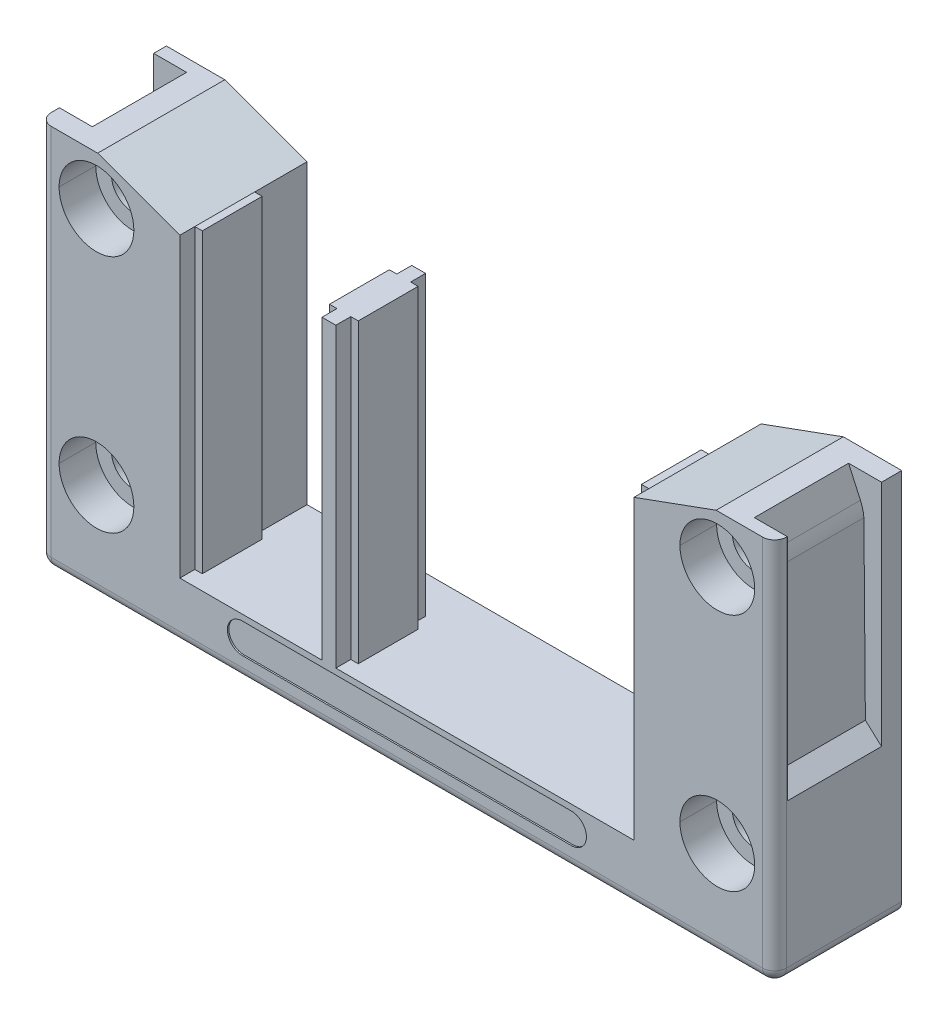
ISO-10303-21;
HEADER;
FILE_DESCRIPTION(('STEP AP214'),'2;1');
FILE_NAME('part.step','',(''),(''),'','','');
FILE_SCHEMA(('AUTOMOTIVE_DESIGN { 1 0 10303 214 1 1 1 1 }'));
ENDSEC;
DATA;
#1=APPLICATION_CONTEXT('core data for automotive mechanical design processes');
#2=APPLICATION_PROTOCOL_DEFINITION('international standard','automotive_design',2000,#1);
#3=PRODUCT_CONTEXT('',#1,'mechanical');
#4=PRODUCT('Part','Part','',(#3));
#5=PRODUCT_RELATED_PRODUCT_CATEGORY('part','',(#4));
#6=PRODUCT_DEFINITION_FORMATION('','',#4);
#7=PRODUCT_DEFINITION_CONTEXT('part definition',#1,'design');
#8=PRODUCT_DEFINITION('design','',#6,#7);
#9=PRODUCT_DEFINITION_SHAPE('','',#8);
#10=(LENGTH_UNIT() NAMED_UNIT(*) SI_UNIT(.MILLI.,.METRE.));
#11=(NAMED_UNIT(*) PLANE_ANGLE_UNIT() SI_UNIT($,.RADIAN.));
#12=(NAMED_UNIT(*) SI_UNIT($,.STERADIAN.) SOLID_ANGLE_UNIT());
#13=UNCERTAINTY_MEASURE_WITH_UNIT(LENGTH_MEASURE(1.E-05),#10,'distance_accuracy_value','');
#14=(GEOMETRIC_REPRESENTATION_CONTEXT(3) GLOBAL_UNCERTAINTY_ASSIGNED_CONTEXT((#13)) GLOBAL_UNIT_ASSIGNED_CONTEXT((#10,
#11,#12)) REPRESENTATION_CONTEXT('',''));
#15=CARTESIAN_POINT('',(0.,0.,0.));
#16=DIRECTION('',(0.,0.,1.));
#17=DIRECTION('',(1.,0.,0.));
#18=AXIS2_PLACEMENT_3D('',#15,#16,#17);
#19=CARTESIAN_POINT('',(-22.,-46.5,8.3));
#20=DIRECTION('',(0.,0.,1.));
#21=DIRECTION('',(1.,0.,0.));
#22=AXIS2_PLACEMENT_3D('',#19,#20,#21);
#23=PLANE('',#22);
#24=CARTESIAN_POINT('',(-22.,-46.5,8.3));
#25=DIRECTION('',(0.,0.,1.));
#26=DIRECTION('',(1.,0.,0.));
#27=AXIS2_PLACEMENT_3D('',#24,#25,#26);
#28=CIRCLE('',#27,2.);
#29=CARTESIAN_POINT('',(-22.,-44.5,8.3));
#30=VERTEX_POINT('',#29);
#31=CARTESIAN_POINT('',(-22.,-48.5,8.3));
#32=VERTEX_POINT('',#31);
#33=EDGE_CURVE('E649',#30,#32,#28,.T.);
#34=ORIENTED_EDGE('',*,*,#33,.T.);
#35=DIRECTION('',(1.,0.,0.));
#36=VECTOR('',#35,1.);
#37=CARTESIAN_POINT('',(-22.,-48.5,8.3));
#38=LINE('',#37,#36);
#39=CARTESIAN_POINT('',(22.,-48.5,8.3));
#40=VERTEX_POINT('',#39);
#41=EDGE_CURVE('E10',#32,#40,#38,.T.);
#42=ORIENTED_EDGE('',*,*,#41,.T.);
#43=CARTESIAN_POINT('',(22.,-46.5,8.3));
#44=DIRECTION('',(0.,0.,1.));
#45=DIRECTION('',(1.,0.,0.));
#46=AXIS2_PLACEMENT_3D('',#43,#44,#45);
#47=CIRCLE('',#46,2.);
#48=CARTESIAN_POINT('',(24.,-46.5,8.3));
#49=VERTEX_POINT('',#48);
#50=EDGE_CURVE('E658',#40,#49,#47,.T.);
#51=ORIENTED_EDGE('',*,*,#50,.T.);
#52=CARTESIAN_POINT('',(22.,-46.5,8.3));
#53=DIRECTION('',(0.,0.,1.));
#54=DIRECTION('',(1.,0.,0.));
#55=AXIS2_PLACEMENT_3D('',#52,#53,#54);
#56=CIRCLE('',#55,2.);
#57=CARTESIAN_POINT('',(22.,-44.5,8.3));
#58=VERTEX_POINT('',#57);
#59=EDGE_CURVE('E1460',#49,#58,#56,.T.);
#60=ORIENTED_EDGE('',*,*,#59,.T.);
#61=DIRECTION('',(-1.,0.,0.));
#62=VECTOR('',#61,1.);
#63=CARTESIAN_POINT('',(-22.,-44.5,8.3));
#64=LINE('',#63,#62);
#65=EDGE_CURVE('E40',#58,#30,#64,.T.);
#66=ORIENTED_EDGE('',*,*,#65,.T.);
#67=EDGE_LOOP('',(#34,#42,#51,#60,#66));
#68=FACE_BOUND('',#67,.T.);
#69=ADVANCED_FACE('F15',(#68),#23,.T.);
#70=CARTESIAN_POINT('',(-22.,-48.5,8.3));
#71=DIRECTION('',(0.,-1.,0.));
#72=DIRECTION('',(0.,0.,-1.));
#73=AXIS2_PLACEMENT_3D('',#70,#71,#72);
#74=PLANE('',#73);
#75=DIRECTION('',(1.,0.,0.));
#76=VECTOR('',#75,1.);
#77=CARTESIAN_POINT('',(-22.,-48.5,8.5));
#78=LINE('',#77,#76);
#79=CARTESIAN_POINT('',(-22.,-48.5,8.5));
#80=VERTEX_POINT('',#79);
#81=CARTESIAN_POINT('',(22.,-48.5,8.5));
#82=VERTEX_POINT('',#81);
#83=EDGE_CURVE('E672',#80,#82,#78,.T.);
#84=ORIENTED_EDGE('',*,*,#83,.T.);
#85=DIRECTION('',(0.,0.,1.));
#86=VECTOR('',#85,1.);
#87=CARTESIAN_POINT('',(22.,-48.5,8.3));
#88=LINE('',#87,#86);
#89=EDGE_CURVE('E23',#40,#82,#88,.T.);
#90=ORIENTED_EDGE('',*,*,#89,.F.);
#91=ORIENTED_EDGE('',*,*,#41,.F.);
#92=DIRECTION('',(0.,0.,1.));
#93=VECTOR('',#92,1.);
#94=CARTESIAN_POINT('',(-22.,-48.5,8.3));
#95=LINE('',#94,#93);
#96=EDGE_CURVE('E646',#32,#80,#95,.T.);
#97=ORIENTED_EDGE('',*,*,#96,.T.);
#98=EDGE_LOOP('',(#84,#90,#91,#97));
#99=FACE_BOUND('',#98,.T.);
#100=ADVANCED_FACE('F673',(#99),#74,.F.);
#101=CARTESIAN_POINT('',(22.,-46.5,8.3));
#102=DIRECTION('',(0.,0.,1.));
#103=DIRECTION('',(1.,0.,0.));
#104=AXIS2_PLACEMENT_3D('',#101,#102,#103);
#105=CYLINDRICAL_SURFACE('',#104,2.);
#106=DIRECTION('',(0.,0.,1.));
#107=VECTOR('',#106,1.);
#108=CARTESIAN_POINT('',(24.,-46.5,8.3));
#109=LINE('',#108,#107);
#110=CARTESIAN_POINT('',(24.,-46.5,8.5));
#111=VERTEX_POINT('',#110);
#112=EDGE_CURVE('E1454',#49,#111,#109,.T.);
#113=ORIENTED_EDGE('',*,*,#112,.F.);
#114=ORIENTED_EDGE('',*,*,#50,.F.);
#115=ORIENTED_EDGE('',*,*,#89,.T.);
#116=CARTESIAN_POINT('',(22.,-46.5,8.5));
#117=DIRECTION('',(0.,0.,1.));
#118=DIRECTION('',(1.,0.,0.));
#119=AXIS2_PLACEMENT_3D('',#116,#117,#118);
#120=CIRCLE('',#119,2.);
#121=EDGE_CURVE('E668',#82,#111,#120,.T.);
#122=ORIENTED_EDGE('',*,*,#121,.T.);
#123=EDGE_LOOP('',(#113,#114,#115,#122));
#124=FACE_BOUND('',#123,.T.);
#125=ADVANCED_FACE('F666',(#124),#105,.F.);
#126=CARTESIAN_POINT('',(-22.,-44.5,8.3));
#127=DIRECTION('',(0.,1.,0.));
#128=DIRECTION('',(1.,0.,0.));
#129=AXIS2_PLACEMENT_3D('',#126,#127,#128);
#130=PLANE('',#129);
#131=DIRECTION('',(-1.,0.,0.));
#132=VECTOR('',#131,1.);
#133=CARTESIAN_POINT('',(-22.,-44.5,8.5));
#134=LINE('',#133,#132);
#135=CARTESIAN_POINT('',(22.,-44.5,8.5));
#136=VERTEX_POINT('',#135);
#137=CARTESIAN_POINT('',(-22.,-44.5,8.5));
#138=VERTEX_POINT('',#137);
#139=EDGE_CURVE('E687',#136,#138,#134,.T.);
#140=ORIENTED_EDGE('',*,*,#139,.T.);
#141=DIRECTION('',(0.,0.,1.));
#142=VECTOR('',#141,1.);
#143=CARTESIAN_POINT('',(-22.,-44.5,8.3));
#144=LINE('',#143,#142);
#145=EDGE_CURVE('E653',#30,#138,#144,.T.);
#146=ORIENTED_EDGE('',*,*,#145,.F.);
#147=ORIENTED_EDGE('',*,*,#65,.F.);
#148=DIRECTION('',(0.,0.,1.));
#149=VECTOR('',#148,1.);
#150=CARTESIAN_POINT('',(22.,-44.5,8.3));
#151=LINE('',#150,#149);
#152=EDGE_CURVE('E1386',#58,#136,#151,.T.);
#153=ORIENTED_EDGE('',*,*,#152,.T.);
#154=EDGE_LOOP('',(#140,#146,#147,#153));
#155=FACE_BOUND('',#154,.T.);
#156=ADVANCED_FACE('F1450',(#155),#130,.F.);
#157=CARTESIAN_POINT('',(-22.,-46.5,8.3));
#158=DIRECTION('',(0.,0.,1.));
#159=DIRECTION('',(1.,0.,0.));
#160=AXIS2_PLACEMENT_3D('',#157,#158,#159);
#161=CYLINDRICAL_SURFACE('',#160,2.);
#162=CARTESIAN_POINT('',(-22.,-46.5,8.5));
#163=DIRECTION('',(0.,0.,1.));
#164=DIRECTION('',(1.,0.,0.));
#165=AXIS2_PLACEMENT_3D('',#162,#163,#164);
#166=CIRCLE('',#165,2.);
#167=EDGE_CURVE('E692',#138,#80,#166,.T.);
#168=ORIENTED_EDGE('',*,*,#167,.T.);
#169=ORIENTED_EDGE('',*,*,#96,.F.);
#170=ORIENTED_EDGE('',*,*,#33,.F.);
#171=ORIENTED_EDGE('',*,*,#145,.T.);
#172=EDGE_LOOP('',(#168,#169,#170,#171));
#173=FACE_BOUND('',#172,.T.);
#174=ADVANCED_FACE('F1446',(#173),#161,.F.);
#175=CARTESIAN_POINT('',(-8.5,-56.3024799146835,-1.5));
#176=DIRECTION('',(-1.,0.,0.));
#177=DIRECTION('',(0.,1.,0.));
#178=AXIS2_PLACEMENT_3D('',#175,#176,#177);
#179=PLANE('',#178);
#180=DIRECTION('',(0.,1.,0.));
#181=VECTOR('',#180,1.);
#182=CARTESIAN_POINT('',(-8.5,-56.3024799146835,6.5));
#183=LINE('',#182,#181);
#184=CARTESIAN_POINT('',(-8.50000000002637,-43.7,6.5));
#185=VERTEX_POINT('',#184);
#186=CARTESIAN_POINT('',(-8.5,-4.,6.5));
#187=VERTEX_POINT('',#186);
#188=EDGE_CURVE('E650',#185,#187,#183,.T.);
#189=ORIENTED_EDGE('',*,*,#188,.F.);
#190=DIRECTION('',(0.,0.,-1.));
#191=VECTOR('',#190,1.);
#192=CARTESIAN_POINT('',(-8.5,-43.7,-1.5));
#193=LINE('',#192,#191);
#194=CARTESIAN_POINT('',(-8.50000000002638,-43.7,-1.5));
#195=VERTEX_POINT('',#194);
#196=EDGE_CURVE('E783',#185,#195,#193,.T.);
#197=ORIENTED_EDGE('',*,*,#196,.T.);
#198=DIRECTION('',(0.,1.,0.));
#199=VECTOR('',#198,1.);
#200=CARTESIAN_POINT('',(-8.5,-56.3024799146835,-1.5));
#201=LINE('',#200,#199);
#202=CARTESIAN_POINT('',(-8.5,-4.,-1.5));
#203=VERTEX_POINT('',#202);
#204=EDGE_CURVE('E628',#195,#203,#201,.T.);
#205=ORIENTED_EDGE('',*,*,#204,.T.);
#206=DIRECTION('',(0.,0.,1.));
#207=VECTOR('',#206,1.);
#208=CARTESIAN_POINT('',(-8.5,-4.,-1.5));
#209=LINE('',#208,#207);
#210=EDGE_CURVE('E1052',#203,#187,#209,.T.);
#211=ORIENTED_EDGE('',*,*,#210,.T.);
#212=EDGE_LOOP('',(#189,#197,#205,#211));
#213=FACE_BOUND('',#212,.T.);
#214=ADVANCED_FACE('F1064',(#213),#179,.F.);
#215=CARTESIAN_POINT('',(-8.5,-56.3024799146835,6.5));
#216=DIRECTION('',(0.,0.,-1.));
#217=DIRECTION('',(0.,-1.,0.));
#218=AXIS2_PLACEMENT_3D('',#215,#216,#217);
#219=PLANE('',#218);
#220=DIRECTION('',(0.,1.,0.));
#221=VECTOR('',#220,1.);
#222=CARTESIAN_POINT('',(-9.5,-56.3024799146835,6.5));
#223=LINE('',#222,#221);
#224=CARTESIAN_POINT('',(-9.50000000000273,-43.7,6.5));
#225=VERTEX_POINT('',#224);
#226=CARTESIAN_POINT('',(-9.5,-4.,6.5));
#227=VERTEX_POINT('',#226);
#228=EDGE_CURVE('E645',#225,#227,#223,.T.);
#229=ORIENTED_EDGE('',*,*,#228,.F.);
#230=DIRECTION('',(1.,0.,0.));
#231=VECTOR('',#230,1.);
#232=CARTESIAN_POINT('',(-8.5,-43.7,6.5));
#233=LINE('',#232,#231);
#234=EDGE_CURVE('E790',#225,#185,#233,.T.);
#235=ORIENTED_EDGE('',*,*,#234,.T.);
#236=ORIENTED_EDGE('',*,*,#188,.T.);
#237=DIRECTION('',(-1.,0.,0.));
#238=VECTOR('',#237,1.);
#239=CARTESIAN_POINT('',(-8.5,-4.,6.5));
#240=LINE('',#239,#238);
#241=EDGE_CURVE('E624',#187,#227,#240,.T.);
#242=ORIENTED_EDGE('',*,*,#241,.T.);
#243=EDGE_LOOP('',(#229,#235,#236,#242));
#244=FACE_BOUND('',#243,.T.);
#245=ADVANCED_FACE('F1551',(#244),#219,.F.);
#246=CARTESIAN_POINT('',(-9.5,-56.3024799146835,6.5));
#247=DIRECTION('',(-1.,0.,0.));
#248=DIRECTION('',(0.,0.,1.));
#249=AXIS2_PLACEMENT_3D('',#246,#247,#248);
#250=PLANE('',#249);
#251=DIRECTION('',(0.,1.,0.));
#252=VECTOR('',#251,1.);
#253=CARTESIAN_POINT('',(-9.5,-56.3024799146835,8.5));
#254=LINE('',#253,#252);
#255=CARTESIAN_POINT('',(-9.5,-43.7,8.5));
#256=VERTEX_POINT('',#255);
#257=CARTESIAN_POINT('',(-9.5,-4.,8.5));
#258=VERTEX_POINT('',#257);
#259=EDGE_CURVE('E1238',#256,#258,#254,.T.);
#260=ORIENTED_EDGE('',*,*,#259,.F.);
#261=DIRECTION('',(0.,0.,-1.));
#262=VECTOR('',#261,1.);
#263=CARTESIAN_POINT('',(-9.5,-43.7,6.5));
#264=LINE('',#263,#262);
#265=EDGE_CURVE('E785',#256,#225,#264,.T.);
#266=ORIENTED_EDGE('',*,*,#265,.T.);
#267=ORIENTED_EDGE('',*,*,#228,.T.);
#268=DIRECTION('',(0.,0.,1.));
#269=VECTOR('',#268,1.);
#270=CARTESIAN_POINT('',(-9.5,-4.,6.5));
#271=LINE('',#270,#269);
#272=EDGE_CURVE('E621',#227,#258,#271,.T.);
#273=ORIENTED_EDGE('',*,*,#272,.T.);
#274=EDGE_LOOP('',(#260,#266,#267,#273));
#275=FACE_BOUND('',#274,.T.);
#276=ADVANCED_FACE('F1554',(#275),#250,.F.);
#277=CARTESIAN_POINT('',(-11.35,-56.3024799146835,6.5));
#278=DIRECTION('',(1.,0.,0.));
#279=DIRECTION('',(0.,0.,1.));
#280=AXIS2_PLACEMENT_3D('',#277,#278,#279);
#281=PLANE('',#280);
#282=DIRECTION('',(0.,1.,0.));
#283=VECTOR('',#282,1.);
#284=CARTESIAN_POINT('',(-11.35,-56.3024799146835,6.5));
#285=LINE('',#284,#283);
#286=CARTESIAN_POINT('',(-11.3499999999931,-43.7,6.5));
#287=VERTEX_POINT('',#286);
#288=CARTESIAN_POINT('',(-11.35,-4.,6.5));
#289=VERTEX_POINT('',#288);
#290=EDGE_CURVE('E642',#287,#289,#285,.T.);
#291=ORIENTED_EDGE('',*,*,#290,.F.);
#292=DIRECTION('',(0.,0.,1.));
#293=VECTOR('',#292,1.);
#294=CARTESIAN_POINT('',(-11.35,-43.7,6.5));
#295=LINE('',#294,#293);
#296=CARTESIAN_POINT('',(-11.3500000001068,-43.7,8.5));
#297=VERTEX_POINT('',#296);
#298=EDGE_CURVE('E772',#287,#297,#295,.T.);
#299=ORIENTED_EDGE('',*,*,#298,.T.);
#300=DIRECTION('',(0.,1.,0.));
#301=VECTOR('',#300,1.);
#302=CARTESIAN_POINT('',(-11.35,-56.3024799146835,8.5));
#303=LINE('',#302,#301);
#304=CARTESIAN_POINT('',(-11.35,-4.,8.5));
#305=VERTEX_POINT('',#304);
#306=EDGE_CURVE('E1249',#297,#305,#303,.T.);
#307=ORIENTED_EDGE('',*,*,#306,.T.);
#308=DIRECTION('',(0.,0.,-1.));
#309=VECTOR('',#308,1.);
#310=CARTESIAN_POINT('',(-11.35,-4.,6.5));
#311=LINE('',#310,#309);
#312=EDGE_CURVE('E617',#305,#289,#311,.T.);
#313=ORIENTED_EDGE('',*,*,#312,.T.);
#314=EDGE_LOOP('',(#291,#299,#307,#313));
#315=FACE_BOUND('',#314,.T.);
#316=ADVANCED_FACE('F1567',(#315),#281,.F.);
#317=CARTESIAN_POINT('',(-11.35,-56.3024799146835,6.5));
#318=DIRECTION('',(0.,0.,-1.));
#319=DIRECTION('',(-1.,0.,0.));
#320=AXIS2_PLACEMENT_3D('',#317,#318,#319);
#321=PLANE('',#320);
#322=DIRECTION('',(0.,1.,0.));
#323=VECTOR('',#322,1.);
#324=CARTESIAN_POINT('',(-12.35,-56.3024799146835,6.5));
#325=LINE('',#324,#323);
#326=CARTESIAN_POINT('',(-12.3500000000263,-43.7,6.5));
#327=VERTEX_POINT('',#326);
#328=CARTESIAN_POINT('',(-12.35,-4.,6.5));
#329=VERTEX_POINT('',#328);
#330=EDGE_CURVE('E641',#327,#329,#325,.T.);
#331=ORIENTED_EDGE('',*,*,#330,.F.);
#332=DIRECTION('',(1.,0.,0.));
#333=VECTOR('',#332,1.);
#334=CARTESIAN_POINT('',(-11.35,-43.7,6.5));
#335=LINE('',#334,#333);
#336=EDGE_CURVE('E1207',#327,#287,#335,.T.);
#337=ORIENTED_EDGE('',*,*,#336,.T.);
#338=ORIENTED_EDGE('',*,*,#290,.T.);
#339=DIRECTION('',(-1.,0.,0.));
#340=VECTOR('',#339,1.);
#341=CARTESIAN_POINT('',(-11.35,-4.,6.5));
#342=LINE('',#341,#340);
#343=EDGE_CURVE('E613',#289,#329,#342,.T.);
#344=ORIENTED_EDGE('',*,*,#343,.T.);
#345=EDGE_LOOP('',(#331,#337,#338,#344));
#346=FACE_BOUND('',#345,.T.);
#347=ADVANCED_FACE('F1563',(#346),#321,.F.);
#348=CARTESIAN_POINT('',(-12.35,-56.3024799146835,-1.5));
#349=DIRECTION('',(1.,0.,0.));
#350=DIRECTION('',(0.,0.,-1.));
#351=AXIS2_PLACEMENT_3D('',#348,#349,#350);
#352=PLANE('',#351);
#353=DIRECTION('',(0.,1.,0.));
#354=VECTOR('',#353,1.);
#355=CARTESIAN_POINT('',(-12.35,-56.3024799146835,-1.5));
#356=LINE('',#355,#354);
#357=CARTESIAN_POINT('',(-12.3500000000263,-43.7,-1.5));
#358=VERTEX_POINT('',#357);
#359=CARTESIAN_POINT('',(-12.35,-4.,-1.5));
#360=VERTEX_POINT('',#359);
#361=EDGE_CURVE('E638',#358,#360,#356,.T.);
#362=ORIENTED_EDGE('',*,*,#361,.F.);
#363=DIRECTION('',(0.,0.,1.));
#364=VECTOR('',#363,1.);
#365=CARTESIAN_POINT('',(-12.35,-43.7,-1.5));
#366=LINE('',#365,#364);
#367=EDGE_CURVE('E1215',#358,#327,#366,.T.);
#368=ORIENTED_EDGE('',*,*,#367,.T.);
#369=ORIENTED_EDGE('',*,*,#330,.T.);
#370=DIRECTION('',(0.,0.,-1.));
#371=VECTOR('',#370,1.);
#372=CARTESIAN_POINT('',(-12.35,-4.,-1.5));
#373=LINE('',#372,#371);
#374=EDGE_CURVE('E609',#329,#360,#373,.T.);
#375=ORIENTED_EDGE('',*,*,#374,.T.);
#376=EDGE_LOOP('',(#362,#368,#369,#375));
#377=FACE_BOUND('',#376,.T.);
#378=ADVANCED_FACE('F1566',(#377),#352,.F.);
#379=CARTESIAN_POINT('',(-11.35,-56.3024799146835,-1.5));
#380=DIRECTION('',(0.,0.,1.));
#381=DIRECTION('',(1.,0.,0.));
#382=AXIS2_PLACEMENT_3D('',#379,#380,#381);
#383=PLANE('',#382);
#384=DIRECTION('',(0.,1.,0.));
#385=VECTOR('',#384,1.);
#386=CARTESIAN_POINT('',(-11.35,-56.3024799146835,-1.5));
#387=LINE('',#386,#385);
#388=CARTESIAN_POINT('',(-11.3499999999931,-43.7,-1.5));
#389=VERTEX_POINT('',#388);
#390=CARTESIAN_POINT('',(-11.35,-4.,-1.5));
#391=VERTEX_POINT('',#390);
#392=EDGE_CURVE('E582',#389,#391,#387,.T.);
#393=ORIENTED_EDGE('',*,*,#392,.F.);
#394=DIRECTION('',(-1.,0.,0.));
#395=VECTOR('',#394,1.);
#396=CARTESIAN_POINT('',(-11.35,-43.7,-1.5));
#397=LINE('',#396,#395);
#398=EDGE_CURVE('E1283',#389,#358,#397,.T.);
#399=ORIENTED_EDGE('',*,*,#398,.T.);
#400=ORIENTED_EDGE('',*,*,#361,.T.);
#401=DIRECTION('',(1.,0.,0.));
#402=VECTOR('',#401,1.);
#403=CARTESIAN_POINT('',(-11.35,-4.,-1.5));
#404=LINE('',#403,#402);
#405=EDGE_CURVE('E592',#360,#391,#404,.T.);
#406=ORIENTED_EDGE('',*,*,#405,.T.);
#407=EDGE_LOOP('',(#393,#399,#400,#406));
#408=FACE_BOUND('',#407,.T.);
#409=ADVANCED_FACE('F1597',(#408),#383,.F.);
#410=CARTESIAN_POINT('',(-11.35,-56.3024799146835,-3.5));
#411=DIRECTION('',(1.,0.,0.));
#412=DIRECTION('',(0.,0.,-1.));
#413=AXIS2_PLACEMENT_3D('',#410,#411,#412);
#414=PLANE('',#413);
#415=DIRECTION('',(0.,1.,0.));
#416=VECTOR('',#415,1.);
#417=CARTESIAN_POINT('',(-11.35,-56.3024799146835,-3.5));
#418=LINE('',#417,#416);
#419=CARTESIAN_POINT('',(-11.3499999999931,-43.7,-3.5));
#420=VERTEX_POINT('',#419);
#421=CARTESIAN_POINT('',(-11.35,-4.,-3.5));
#422=VERTEX_POINT('',#421);
#423=EDGE_CURVE('E570',#420,#422,#418,.T.);
#424=ORIENTED_EDGE('',*,*,#423,.F.);
#425=DIRECTION('',(0.,0.,1.));
#426=VECTOR('',#425,1.);
#427=CARTESIAN_POINT('',(-11.35,-43.7,-3.5));
#428=LINE('',#427,#426);
#429=EDGE_CURVE('E1083',#420,#389,#428,.T.);
#430=ORIENTED_EDGE('',*,*,#429,.T.);
#431=ORIENTED_EDGE('',*,*,#392,.T.);
#432=DIRECTION('',(0.,0.,-1.));
#433=VECTOR('',#432,1.);
#434=CARTESIAN_POINT('',(-11.35,-4.,-3.5));
#435=LINE('',#434,#433);
#436=EDGE_CURVE('E586',#391,#422,#435,.T.);
#437=ORIENTED_EDGE('',*,*,#436,.T.);
#438=EDGE_LOOP('',(#424,#430,#431,#437));
#439=FACE_BOUND('',#438,.T.);
#440=ADVANCED_FACE('F587',(#439),#414,.F.);
#441=CARTESIAN_POINT('',(-9.5,-56.3024799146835,-3.5));
#442=DIRECTION('',(0.,0.,1.));
#443=DIRECTION('',(1.,0.,0.));
#444=AXIS2_PLACEMENT_3D('',#441,#442,#443);
#445=PLANE('',#444);
#446=DIRECTION('',(0.,1.,0.));
#447=VECTOR('',#446,1.);
#448=CARTESIAN_POINT('',(-9.5,-56.3024799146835,-3.5));
#449=LINE('',#448,#447);
#450=CARTESIAN_POINT('',(-9.50000000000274,-43.7,-3.5));
#451=VERTEX_POINT('',#450);
#452=CARTESIAN_POINT('',(-9.5,-4.,-3.5));
#453=VERTEX_POINT('',#452);
#454=EDGE_CURVE('E583',#451,#453,#449,.T.);
#455=ORIENTED_EDGE('',*,*,#454,.F.);
#456=DIRECTION('',(-1.,0.,0.));
#457=VECTOR('',#456,1.);
#458=CARTESIAN_POINT('',(-9.5,-43.7,-3.5));
#459=LINE('',#458,#457);
#460=EDGE_CURVE('E577',#451,#420,#459,.T.);
#461=ORIENTED_EDGE('',*,*,#460,.T.);
#462=ORIENTED_EDGE('',*,*,#423,.T.);
#463=DIRECTION('',(1.,0.,0.));
#464=VECTOR('',#463,1.);
#465=CARTESIAN_POINT('',(-9.5,-4.,-3.5));
#466=LINE('',#465,#464);
#467=EDGE_CURVE('E574',#422,#453,#466,.T.);
#468=ORIENTED_EDGE('',*,*,#467,.T.);
#469=EDGE_LOOP('',(#455,#461,#462,#468));
#470=FACE_BOUND('',#469,.T.);
#471=ADVANCED_FACE('F572',(#470),#445,.F.);
#472=CARTESIAN_POINT('',(-9.5,-56.3024799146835,-3.5));
#473=DIRECTION('',(-1.,0.,0.));
#474=DIRECTION('',(0.,1.,0.));
#475=AXIS2_PLACEMENT_3D('',#472,#473,#474);
#476=PLANE('',#475);
#477=DIRECTION('',(0.,1.,0.));
#478=VECTOR('',#477,1.);
#479=CARTESIAN_POINT('',(-9.5,-56.3024799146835,-1.5));
#480=LINE('',#479,#478);
#481=CARTESIAN_POINT('',(-9.50000000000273,-43.7,-1.5));
#482=VERTEX_POINT('',#481);
#483=CARTESIAN_POINT('',(-9.5,-4.,-1.5));
#484=VERTEX_POINT('',#483);
#485=EDGE_CURVE('E631',#482,#484,#480,.T.);
#486=ORIENTED_EDGE('',*,*,#485,.F.);
#487=DIRECTION('',(0.,0.,-1.));
#488=VECTOR('',#487,1.);
#489=CARTESIAN_POINT('',(-9.5,-43.7,-3.5));
#490=LINE('',#489,#488);
#491=EDGE_CURVE('E784',#482,#451,#490,.T.);
#492=ORIENTED_EDGE('',*,*,#491,.T.);
#493=ORIENTED_EDGE('',*,*,#454,.T.);
#494=DIRECTION('',(0.,0.,1.));
#495=VECTOR('',#494,1.);
#496=CARTESIAN_POINT('',(-9.5,-4.,-3.5));
#497=LINE('',#496,#495);
#498=EDGE_CURVE('E598',#453,#484,#497,.T.);
#499=ORIENTED_EDGE('',*,*,#498,.T.);
#500=EDGE_LOOP('',(#486,#492,#493,#499));
#501=FACE_BOUND('',#500,.T.);
#502=ADVANCED_FACE('F1592',(#501),#476,.F.);
#503=CARTESIAN_POINT('',(-8.5,-56.3024799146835,-1.5));
#504=DIRECTION('',(0.,0.,1.));
#505=DIRECTION('',(1.,0.,0.));
#506=AXIS2_PLACEMENT_3D('',#503,#504,#505);
#507=PLANE('',#506);
#508=ORIENTED_EDGE('',*,*,#204,.F.);
#509=DIRECTION('',(-1.,0.,0.));
#510=VECTOR('',#509,1.);
#511=CARTESIAN_POINT('',(-8.5,-43.7,-1.5));
#512=LINE('',#511,#510);
#513=EDGE_CURVE('E779',#195,#482,#512,.T.);
#514=ORIENTED_EDGE('',*,*,#513,.T.);
#515=ORIENTED_EDGE('',*,*,#485,.T.);
#516=DIRECTION('',(1.,0.,0.));
#517=VECTOR('',#516,1.);
#518=CARTESIAN_POINT('',(-8.5,-4.,-1.5));
#519=LINE('',#518,#517);
#520=EDGE_CURVE('E603',#484,#203,#519,.T.);
#521=ORIENTED_EDGE('',*,*,#520,.T.);
#522=EDGE_LOOP('',(#508,#514,#515,#521));
#523=FACE_BOUND('',#522,.T.);
#524=ADVANCED_FACE('F1059',(#523),#507,.F.);
#525=CARTESIAN_POINT('',(0.,-4.,0.));
#526=DIRECTION('',(0.,-1.,0.));
#527=DIRECTION('',(0.,0.,-1.));
#528=AXIS2_PLACEMENT_3D('',#525,#526,#527);
#529=PLANE('',#528);
#530=ORIENTED_EDGE('',*,*,#210,.F.);
#531=ORIENTED_EDGE('',*,*,#520,.F.);
#532=ORIENTED_EDGE('',*,*,#498,.F.);
#533=ORIENTED_EDGE('',*,*,#467,.F.);
#534=ORIENTED_EDGE('',*,*,#436,.F.);
#535=ORIENTED_EDGE('',*,*,#405,.F.);
#536=ORIENTED_EDGE('',*,*,#374,.F.);
#537=ORIENTED_EDGE('',*,*,#343,.F.);
#538=ORIENTED_EDGE('',*,*,#312,.F.);
#539=DIRECTION('',(-1.,0.,0.));
#540=VECTOR('',#539,1.);
#541=CARTESIAN_POINT('',(-9.5,-4.,8.5));
#542=LINE('',#541,#540);
#543=EDGE_CURVE('E1243',#258,#305,#542,.T.);
#544=ORIENTED_EDGE('',*,*,#543,.F.);
#545=ORIENTED_EDGE('',*,*,#272,.F.);
#546=ORIENTED_EDGE('',*,*,#241,.F.);
#547=EDGE_LOOP('',(#530,#531,#532,#533,#534,#535,#536,#537,#538,#544,#545,#546));
#548=FACE_BOUND('',#547,.T.);
#549=ADVANCED_FACE('F595',(#548),#529,.F.);
#550=CARTESIAN_POINT('',(29.35,-56.3024799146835,-1.50000000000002));
#551=DIRECTION('',(0.,0.,1.));
#552=DIRECTION('',(1.,0.,0.));
#553=AXIS2_PLACEMENT_3D('',#550,#551,#552);
#554=PLANE('',#553);
#555=DIRECTION('',(0.,1.,0.));
#556=VECTOR('',#555,1.);
#557=CARTESIAN_POINT('',(30.35,-56.3024799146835,-1.50000000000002));
#558=LINE('',#557,#556);
#559=CARTESIAN_POINT('',(30.3499999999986,-43.7,-1.50000000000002));
#560=VERTEX_POINT('',#559);
#561=CARTESIAN_POINT('',(30.35,-4.,-1.5));
#562=VERTEX_POINT('',#561);
#563=EDGE_CURVE('E806',#560,#562,#558,.T.);
#564=ORIENTED_EDGE('',*,*,#563,.F.);
#565=DIRECTION('',(-1.,0.,0.));
#566=VECTOR('',#565,1.);
#567=CARTESIAN_POINT('',(29.35,-43.7,-1.50000000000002));
#568=LINE('',#567,#566);
#569=CARTESIAN_POINT('',(29.3499999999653,-43.7,-1.50000000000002));
#570=VERTEX_POINT('',#569);
#571=EDGE_CURVE('E801',#560,#570,#568,.T.);
#572=ORIENTED_EDGE('',*,*,#571,.T.);
#573=DIRECTION('',(0.,1.,0.));
#574=VECTOR('',#573,1.);
#575=CARTESIAN_POINT('',(29.35,-56.3024799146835,-1.50000000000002));
#576=LINE('',#575,#574);
#577=CARTESIAN_POINT('',(29.35,-4.,-1.5));
#578=VERTEX_POINT('',#577);
#579=EDGE_CURVE('E1046',#570,#578,#576,.T.);
#580=ORIENTED_EDGE('',*,*,#579,.T.);
#581=DIRECTION('',(1.,0.,0.));
#582=VECTOR('',#581,1.);
#583=CARTESIAN_POINT('',(29.35,-4.,-1.5));
#584=LINE('',#583,#582);
#585=EDGE_CURVE('E1038',#578,#562,#584,.T.);
#586=ORIENTED_EDGE('',*,*,#585,.T.);
#587=EDGE_LOOP('',(#564,#572,#580,#586));
#588=FACE_BOUND('',#587,.T.);
#589=ADVANCED_FACE('F1532',(#588),#554,.F.);
#590=CARTESIAN_POINT('',(29.35,-56.3024799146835,6.5));
#591=DIRECTION('',(0.,0.,-1.));
#592=DIRECTION('',(-1.,0.,0.));
#593=AXIS2_PLACEMENT_3D('',#590,#591,#592);
#594=PLANE('',#593);
#595=DIRECTION('',(0.,1.,0.));
#596=VECTOR('',#595,1.);
#597=CARTESIAN_POINT('',(29.35,-56.3024799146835,6.5));
#598=LINE('',#597,#596);
#599=CARTESIAN_POINT('',(29.3500000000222,-43.7,6.5));
#600=VERTEX_POINT('',#599);
#601=CARTESIAN_POINT('',(29.35,-4.,6.5));
#602=VERTEX_POINT('',#601);
#603=EDGE_CURVE('E1049',#600,#602,#598,.T.);
#604=ORIENTED_EDGE('',*,*,#603,.F.);
#605=DIRECTION('',(1.,0.,0.));
#606=VECTOR('',#605,1.);
#607=CARTESIAN_POINT('',(29.35,-43.7,6.5));
#608=LINE('',#607,#606);
#609=CARTESIAN_POINT('',(30.3499999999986,-43.7,6.5));
#610=VERTEX_POINT('',#609);
#611=EDGE_CURVE('E793',#600,#610,#608,.T.);
#612=ORIENTED_EDGE('',*,*,#611,.T.);
#613=DIRECTION('',(0.,1.,0.));
#614=VECTOR('',#613,1.);
#615=CARTESIAN_POINT('',(30.35,-56.3024799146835,6.5));
#616=LINE('',#615,#614);
#617=CARTESIAN_POINT('',(30.35,-4.,6.5));
#618=VERTEX_POINT('',#617);
#619=EDGE_CURVE('E805',#610,#618,#616,.T.);
#620=ORIENTED_EDGE('',*,*,#619,.T.);
#621=DIRECTION('',(-1.,0.,0.));
#622=VECTOR('',#621,1.);
#623=CARTESIAN_POINT('',(29.35,-4.,6.5));
#624=LINE('',#623,#622);
#625=EDGE_CURVE('E1042',#618,#602,#624,.T.);
#626=ORIENTED_EDGE('',*,*,#625,.T.);
#627=EDGE_LOOP('',(#604,#612,#620,#626));
#628=FACE_BOUND('',#627,.T.);
#629=ADVANCED_FACE('F1585',(#628),#594,.F.);
#630=CARTESIAN_POINT('',(29.35,-56.3024799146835,-1.50000000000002));
#631=DIRECTION('',(1.,0.,0.));
#632=DIRECTION('',(0.,1.,0.));
#633=AXIS2_PLACEMENT_3D('',#630,#631,#632);
#634=PLANE('',#633);
#635=ORIENTED_EDGE('',*,*,#579,.F.);
#636=DIRECTION('',(0.,0.,1.));
#637=VECTOR('',#636,1.);
#638=CARTESIAN_POINT('',(29.35,-43.7,-1.50000000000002));
#639=LINE('',#638,#637);
#640=EDGE_CURVE('E797',#570,#600,#639,.T.);
#641=ORIENTED_EDGE('',*,*,#640,.T.);
#642=ORIENTED_EDGE('',*,*,#603,.T.);
#643=DIRECTION('',(0.,0.,-1.));
#644=VECTOR('',#643,1.);
#645=CARTESIAN_POINT('',(29.35,-4.,-1.5));
#646=LINE('',#645,#644);
#647=EDGE_CURVE('E1041',#602,#578,#646,.T.);
#648=ORIENTED_EDGE('',*,*,#647,.T.);
#649=EDGE_LOOP('',(#635,#641,#642,#648));
#650=FACE_BOUND('',#649,.T.);
#651=ADVANCED_FACE('F1581',(#650),#634,.F.);
#652=CARTESIAN_POINT('',(0.,-4.,0.));
#653=DIRECTION('',(0.,-1.,0.));
#654=DIRECTION('',(0.,0.,-1.));
#655=AXIS2_PLACEMENT_3D('',#652,#653,#654);
#656=PLANE('',#655);
#657=ORIENTED_EDGE('',*,*,#585,.F.);
#658=ORIENTED_EDGE('',*,*,#647,.F.);
#659=ORIENTED_EDGE('',*,*,#625,.F.);
#660=DIRECTION('',(0.,0.,1.));
#661=VECTOR('',#660,1.);
#662=CARTESIAN_POINT('',(30.35,-4.,-1.5));
#663=LINE('',#662,#661);
#664=EDGE_CURVE('E910',#562,#618,#663,.T.);
#665=ORIENTED_EDGE('',*,*,#664,.F.);
#666=EDGE_LOOP('',(#657,#658,#659,#665));
#667=FACE_BOUND('',#666,.T.);
#668=ADVANCED_FACE('F1578',(#667),#656,.F.);
#669=CARTESIAN_POINT('',(-30.35,-56.3024799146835,-1.5));
#670=DIRECTION('',(0.,0.,1.));
#671=DIRECTION('',(1.,0.,0.));
#672=AXIS2_PLACEMENT_3D('',#669,#670,#671);
#673=PLANE('',#672);
#674=DIRECTION('',(0.,1.,0.));
#675=VECTOR('',#674,1.);
#676=CARTESIAN_POINT('',(-29.35,-56.3024799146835,-1.5));
#677=LINE('',#676,#675);
#678=CARTESIAN_POINT('',(-29.3499999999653,-43.7,-1.5));
#679=VERTEX_POINT('',#678);
#680=CARTESIAN_POINT('',(-29.35,-4.,-1.5));
#681=VERTEX_POINT('',#680);
#682=EDGE_CURVE('E1035',#679,#681,#677,.T.);
#683=ORIENTED_EDGE('',*,*,#682,.F.);
#684=DIRECTION('',(-1.,0.,0.));
#685=VECTOR('',#684,1.);
#686=CARTESIAN_POINT('',(-30.35,-43.7,-1.5));
#687=LINE('',#686,#685);
#688=CARTESIAN_POINT('',(-30.35,-43.7,-1.5));
#689=VERTEX_POINT('',#688);
#690=EDGE_CURVE('E741',#679,#689,#687,.T.);
#691=ORIENTED_EDGE('',*,*,#690,.T.);
#692=DIRECTION('',(0.,1.,0.));
#693=VECTOR('',#692,1.);
#694=CARTESIAN_POINT('',(-30.35,-56.3024799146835,-1.5));
#695=LINE('',#694,#693);
#696=CARTESIAN_POINT('',(-30.35,-4.,-1.5));
#697=VERTEX_POINT('',#696);
#698=EDGE_CURVE('E714',#689,#697,#695,.T.);
#699=ORIENTED_EDGE('',*,*,#698,.T.);
#700=DIRECTION('',(1.,0.,0.));
#701=VECTOR('',#700,1.);
#702=CARTESIAN_POINT('',(-30.35,-4.,-1.5));
#703=LINE('',#702,#701);
#704=EDGE_CURVE('E977',#697,#681,#703,.T.);
#705=ORIENTED_EDGE('',*,*,#704,.T.);
#706=EDGE_LOOP('',(#683,#691,#699,#705));
#707=FACE_BOUND('',#706,.T.);
#708=ADVANCED_FACE('F1576',(#707),#673,.F.);
#709=CARTESIAN_POINT('',(-29.35,-56.3024799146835,-1.5));
#710=DIRECTION('',(-1.,0.,0.));
#711=DIRECTION('',(0.,1.,0.));
#712=AXIS2_PLACEMENT_3D('',#709,#710,#711);
#713=PLANE('',#712);
#714=DIRECTION('',(0.,1.,0.));
#715=VECTOR('',#714,1.);
#716=CARTESIAN_POINT('',(-29.35,-56.3024799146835,6.5));
#717=LINE('',#716,#715);
#718=CARTESIAN_POINT('',(-29.35,-43.7,6.5));
#719=VERTEX_POINT('',#718);
#720=CARTESIAN_POINT('',(-29.35,-4.,6.5));
#721=VERTEX_POINT('',#720);
#722=EDGE_CURVE('E1032',#719,#721,#717,.T.);
#723=ORIENTED_EDGE('',*,*,#722,.F.);
#724=DIRECTION('',(0.,0.,-1.));
#725=VECTOR('',#724,1.);
#726=CARTESIAN_POINT('',(-29.35,-43.7,-1.5));
#727=LINE('',#726,#725);
#728=EDGE_CURVE('E749',#719,#679,#727,.T.);
#729=ORIENTED_EDGE('',*,*,#728,.T.);
#730=ORIENTED_EDGE('',*,*,#682,.T.);
#731=DIRECTION('',(0.,0.,1.));
#732=VECTOR('',#731,1.);
#733=CARTESIAN_POINT('',(-29.35,-4.,-1.5));
#734=LINE('',#733,#732);
#735=EDGE_CURVE('E976',#681,#721,#734,.T.);
#736=ORIENTED_EDGE('',*,*,#735,.T.);
#737=EDGE_LOOP('',(#723,#729,#730,#736));
#738=FACE_BOUND('',#737,.T.);
#739=ADVANCED_FACE('F1573',(#738),#713,.F.);
#740=CARTESIAN_POINT('',(-30.35,-56.3024799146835,6.5));
#741=DIRECTION('',(0.,0.,-1.));
#742=DIRECTION('',(0.,-1.,0.));
#743=AXIS2_PLACEMENT_3D('',#740,#741,#742);
#744=PLANE('',#743);
#745=DIRECTION('',(0.,1.,0.));
#746=VECTOR('',#745,1.);
#747=CARTESIAN_POINT('',(-30.35,-56.3024799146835,6.5));
#748=LINE('',#747,#746);
#749=CARTESIAN_POINT('',(-30.35,-43.7,6.5));
#750=VERTEX_POINT('',#749);
#751=CARTESIAN_POINT('',(-30.35,-4.,6.5));
#752=VERTEX_POINT('',#751);
#753=EDGE_CURVE('E818',#750,#752,#748,.T.);
#754=ORIENTED_EDGE('',*,*,#753,.F.);
#755=DIRECTION('',(1.,0.,0.));
#756=VECTOR('',#755,1.);
#757=CARTESIAN_POINT('',(-30.35,-43.7,6.5));
#758=LINE('',#757,#756);
#759=EDGE_CURVE('E757',#750,#719,#758,.T.);
#760=ORIENTED_EDGE('',*,*,#759,.T.);
#761=ORIENTED_EDGE('',*,*,#722,.T.);
#762=DIRECTION('',(-1.,0.,0.));
#763=VECTOR('',#762,1.);
#764=CARTESIAN_POINT('',(-30.35,-4.,6.5));
#765=LINE('',#764,#763);
#766=EDGE_CURVE('E973',#721,#752,#765,.T.);
#767=ORIENTED_EDGE('',*,*,#766,.T.);
#768=EDGE_LOOP('',(#754,#760,#761,#767));
#769=FACE_BOUND('',#768,.T.);
#770=ADVANCED_FACE('F1571',(#769),#744,.F.);
#771=CARTESIAN_POINT('',(0.,-4.,0.));
#772=DIRECTION('',(0.,-1.,0.));
#773=DIRECTION('',(0.,0.,-1.));
#774=AXIS2_PLACEMENT_3D('',#771,#772,#773);
#775=PLANE('',#774);
#776=ORIENTED_EDGE('',*,*,#704,.F.);
#777=DIRECTION('',(0.,0.,-1.));
#778=VECTOR('',#777,1.);
#779=CARTESIAN_POINT('',(-30.35,-4.,-1.5));
#780=LINE('',#779,#778);
#781=EDGE_CURVE('E709',#752,#697,#780,.T.);
#782=ORIENTED_EDGE('',*,*,#781,.F.);
#783=ORIENTED_EDGE('',*,*,#766,.F.);
#784=ORIENTED_EDGE('',*,*,#735,.F.);
#785=EDGE_LOOP('',(#776,#782,#783,#784));
#786=FACE_BOUND('',#785,.T.);
#787=ADVANCED_FACE('F1562',(#786),#775,.F.);
#788=CARTESIAN_POINT('',(-47.55,-49.9,-8.5));
#789=DIRECTION('',(0.,0.,1.));
#790=DIRECTION('',(1.,0.,0.));
#791=AXIS2_PLACEMENT_3D('',#788,#789,#790);
#792=CYLINDRICAL_SURFACE('',#791,1.6);
#793=CARTESIAN_POINT('',(-47.55,-49.9,-8.5));
#794=DIRECTION('',(0.,0.,-1.));
#795=DIRECTION('',(1.,0.,0.));
#796=AXIS2_PLACEMENT_3D('',#793,#794,#795);
#797=CIRCLE('',#796,1.6);
#798=CARTESIAN_POINT('',(-47.55,-51.5,-8.5));
#799=VERTEX_POINT('',#798);
#800=CARTESIAN_POINT('',(-49.15,-49.9,-8.5));
#801=VERTEX_POINT('',#800);
#802=EDGE_CURVE('E842',#799,#801,#797,.T.);
#803=ORIENTED_EDGE('',*,*,#802,.F.);
#804=DIRECTION('',(0.,0.,-1.));
#805=VECTOR('',#804,1.);
#806=CARTESIAN_POINT('',(-47.55,-51.5,-8.5));
#807=LINE('',#806,#805);
#808=CARTESIAN_POINT('',(-47.55,-51.5,6.9));
#809=VERTEX_POINT('',#808);
#810=EDGE_CURVE('E696',#809,#799,#807,.T.);
#811=ORIENTED_EDGE('',*,*,#810,.F.);
#812=CARTESIAN_POINT('',(-47.55,-49.9,6.9));
#813=DIRECTION('',(0.,0.,-1.));
#814=DIRECTION('',(1.,0.,0.));
#815=AXIS2_PLACEMENT_3D('',#812,#813,#814);
#816=CIRCLE('',#815,1.6);
#817=CARTESIAN_POINT('',(-49.15,-49.9,6.9));
#818=VERTEX_POINT('',#817);
#819=EDGE_CURVE('E1023',#809,#818,#816,.T.);
#820=ORIENTED_EDGE('',*,*,#819,.T.);
#821=DIRECTION('',(0.,0.,1.));
#822=VECTOR('',#821,1.);
#823=CARTESIAN_POINT('',(-49.15,-49.9,-8.5));
#824=LINE('',#823,#822);
#825=EDGE_CURVE('E732',#801,#818,#824,.T.);
#826=ORIENTED_EDGE('',*,*,#825,.F.);
#827=EDGE_LOOP('',(#803,#811,#820,#826));
#828=FACE_BOUND('',#827,.T.);
#829=ADVANCED_FACE('F1368',(#828),#792,.T.);
#830=CARTESIAN_POINT('',(-47.55,-49.9,6.9));
#831=DIRECTION('',(0.,1.,0.));
#832=DIRECTION('',(1.,0.,0.));
#833=AXIS2_PLACEMENT_3D('',#830,#831,#832);
#834=SPHERICAL_SURFACE('',#833,1.6);
#835=CARTESIAN_POINT('',(-47.55,-49.9,6.9));
#836=DIRECTION('',(-1.,0.,0.));
#837=DIRECTION('',(0.,0.,1.));
#838=AXIS2_PLACEMENT_3D('',#835,#836,#837);
#839=CIRCLE('',#838,1.6);
#840=CARTESIAN_POINT('',(-47.55,-49.9,8.5));
#841=VERTEX_POINT('',#840);
#842=EDGE_CURVE('E1020',#809,#841,#839,.T.);
#843=ORIENTED_EDGE('',*,*,#842,.T.);
#844=CARTESIAN_POINT('',(-47.55,-49.9,6.9));
#845=DIRECTION('',(0.,-1.,0.));
#846=DIRECTION('',(0.,0.,-1.));
#847=AXIS2_PLACEMENT_3D('',#844,#845,#846);
#848=CIRCLE('',#847,1.6);
#849=EDGE_CURVE('E1016',#841,#818,#848,.T.);
#850=ORIENTED_EDGE('',*,*,#849,.T.);
#851=ORIENTED_EDGE('',*,*,#819,.F.);
#852=EDGE_LOOP('',(#843,#850,#851));
#853=FACE_BOUND('',#852,.T.);
#854=ADVANCED_FACE('F1556',(#853),#834,.T.);
#855=CARTESIAN_POINT('',(-49.15,-49.9,6.9));
#856=DIRECTION('',(1.,0.,0.));
#857=DIRECTION('',(0.,0.,-1.));
#858=AXIS2_PLACEMENT_3D('',#855,#856,#857);
#859=CYLINDRICAL_SURFACE('',#858,1.6);
#860=CARTESIAN_POINT('',(47.55,-49.9,6.9));
#861=DIRECTION('',(-1.,0.,0.));
#862=DIRECTION('',(0.,1.,0.));
#863=AXIS2_PLACEMENT_3D('',#860,#861,#862);
#864=CIRCLE('',#863,1.6);
#865=CARTESIAN_POINT('',(47.55,-51.5,6.9));
#866=VERTEX_POINT('',#865);
#867=CARTESIAN_POINT('',(47.55,-49.9,8.5));
#868=VERTEX_POINT('',#867);
#869=EDGE_CURVE('E1013',#866,#868,#864,.T.);
#870=ORIENTED_EDGE('',*,*,#869,.T.);
#871=DIRECTION('',(1.,0.,0.));
#872=VECTOR('',#871,1.);
#873=CARTESIAN_POINT('',(-49.15,-49.9,8.5));
#874=LINE('',#873,#872);
#875=EDGE_CURVE('E1266',#841,#868,#874,.T.);
#876=ORIENTED_EDGE('',*,*,#875,.F.);
#877=ORIENTED_EDGE('',*,*,#842,.F.);
#878=DIRECTION('',(-1.,0.,0.));
#879=VECTOR('',#878,1.);
#880=CARTESIAN_POINT('',(-49.15,-51.5,6.9));
#881=LINE('',#880,#879);
#882=EDGE_CURVE('E700',#866,#809,#881,.T.);
#883=ORIENTED_EDGE('',*,*,#882,.F.);
#884=EDGE_LOOP('',(#870,#876,#877,#883));
#885=FACE_BOUND('',#884,.T.);
#886=ADVANCED_FACE('F1355',(#885),#859,.T.);
#887=CARTESIAN_POINT('',(-47.55,-51.5,6.9));
#888=DIRECTION('',(0.,-1.,0.));
#889=DIRECTION('',(1.,0.,0.));
#890=AXIS2_PLACEMENT_3D('',#887,#888,#889);
#891=CYLINDRICAL_SURFACE('',#890,1.6);
#892=CARTESIAN_POINT('',(-47.55,0.,6.9));
#893=DIRECTION('',(0.,1.,0.));
#894=DIRECTION('',(0.,0.,1.));
#895=AXIS2_PLACEMENT_3D('',#892,#893,#894);
#896=CIRCLE('',#895,1.6);
#897=CARTESIAN_POINT('',(-49.15,0.,6.9));
#898=VERTEX_POINT('',#897);
#899=CARTESIAN_POINT('',(-47.55,0.,8.5));
#900=VERTEX_POINT('',#899);
#901=EDGE_CURVE('E1151',#898,#900,#896,.T.);
#902=ORIENTED_EDGE('',*,*,#901,.F.);
#903=DIRECTION('',(0.,1.,0.));
#904=VECTOR('',#903,1.);
#905=CARTESIAN_POINT('',(-49.15,0.,6.9));
#906=LINE('',#905,#904);
#907=EDGE_CURVE('E736',#818,#898,#906,.T.);
#908=ORIENTED_EDGE('',*,*,#907,.F.);
#909=ORIENTED_EDGE('',*,*,#849,.F.);
#910=DIRECTION('',(0.,-1.,0.));
#911=VECTOR('',#910,1.);
#912=CARTESIAN_POINT('',(-47.55,-51.5,8.5));
#913=LINE('',#912,#911);
#914=EDGE_CURVE('E1118',#900,#841,#913,.T.);
#915=ORIENTED_EDGE('',*,*,#914,.F.);
#916=EDGE_LOOP('',(#902,#908,#909,#915));
#917=FACE_BOUND('',#916,.T.);
#918=ADVANCED_FACE('F1541',(#917),#891,.T.);
#919=CARTESIAN_POINT('',(47.55,-49.9,6.9));
#920=DIRECTION('',(0.,1.,0.));
#921=DIRECTION('',(1.,0.,0.));
#922=AXIS2_PLACEMENT_3D('',#919,#920,#921);
#923=SPHERICAL_SURFACE('',#922,1.6);
#924=CARTESIAN_POINT('',(47.55,-49.9,6.9));
#925=DIRECTION('',(0.,0.,1.));
#926=DIRECTION('',(1.,0.,0.));
#927=AXIS2_PLACEMENT_3D('',#924,#925,#926);
#928=CIRCLE('',#927,1.6);
#929=CARTESIAN_POINT('',(49.15,-49.9,6.9));
#930=VERTEX_POINT('',#929);
#931=EDGE_CURVE('E1010',#866,#930,#928,.T.);
#932=ORIENTED_EDGE('',*,*,#931,.T.);
#933=CARTESIAN_POINT('',(47.55,-49.9,6.9));
#934=DIRECTION('',(0.,-1.,0.));
#935=DIRECTION('',(0.,0.,-1.));
#936=AXIS2_PLACEMENT_3D('',#933,#934,#935);
#937=CIRCLE('',#936,1.6);
#938=EDGE_CURVE('E1006',#930,#868,#937,.T.);
#939=ORIENTED_EDGE('',*,*,#938,.T.);
#940=ORIENTED_EDGE('',*,*,#869,.F.);
#941=EDGE_LOOP('',(#932,#939,#940));
#942=FACE_BOUND('',#941,.T.);
#943=ADVANCED_FACE('F1360',(#942),#923,.T.);
#944=CARTESIAN_POINT('',(47.55,-49.9,-8.5));
#945=DIRECTION('',(0.,0.,1.));
#946=DIRECTION('',(1.,0.,0.));
#947=AXIS2_PLACEMENT_3D('',#944,#945,#946);
#948=CYLINDRICAL_SURFACE('',#947,1.6);
#949=CARTESIAN_POINT('',(47.55,-49.9,-8.5));
#950=DIRECTION('',(0.,0.,-1.));
#951=DIRECTION('',(1.,0.,0.));
#952=AXIS2_PLACEMENT_3D('',#949,#950,#951);
#953=CIRCLE('',#952,1.6);
#954=CARTESIAN_POINT('',(49.15,-49.9,-8.5));
#955=VERTEX_POINT('',#954);
#956=CARTESIAN_POINT('',(47.55,-51.5,-8.5));
#957=VERTEX_POINT('',#956);
#958=EDGE_CURVE('E860',#955,#957,#953,.T.);
#959=ORIENTED_EDGE('',*,*,#958,.F.);
#960=DIRECTION('',(0.,0.,-1.));
#961=VECTOR('',#960,1.);
#962=CARTESIAN_POINT('',(49.15,-49.9,-8.5));
#963=LINE('',#962,#961);
#964=EDGE_CURVE('E875',#930,#955,#963,.T.);
#965=ORIENTED_EDGE('',*,*,#964,.F.);
#966=ORIENTED_EDGE('',*,*,#931,.F.);
#967=DIRECTION('',(0.,0.,1.));
#968=VECTOR('',#967,1.);
#969=CARTESIAN_POINT('',(47.55,-51.5,-8.5));
#970=LINE('',#969,#968);
#971=EDGE_CURVE('E699',#957,#866,#970,.T.);
#972=ORIENTED_EDGE('',*,*,#971,.F.);
#973=EDGE_LOOP('',(#959,#965,#966,#972));
#974=FACE_BOUND('',#973,.T.);
#975=ADVANCED_FACE('F1339',(#974),#948,.T.);
#976=CARTESIAN_POINT('',(47.55,0.,6.9));
#977=DIRECTION('',(0.,-1.,0.));
#978=DIRECTION('',(1.,0.,0.));
#979=AXIS2_PLACEMENT_3D('',#976,#977,#978);
#980=CYLINDRICAL_SURFACE('',#979,1.6);
#981=CARTESIAN_POINT('',(47.55,0.,6.9));
#982=DIRECTION('',(0.,1.,0.));
#983=DIRECTION('',(0.,0.,1.));
#984=AXIS2_PLACEMENT_3D('',#981,#982,#983);
#985=CIRCLE('',#984,1.6);
#986=CARTESIAN_POINT('',(47.55,0.,8.5));
#987=VERTEX_POINT('',#986);
#988=CARTESIAN_POINT('',(49.15,0.,6.9));
#989=VERTEX_POINT('',#988);
#990=EDGE_CURVE('E892',#987,#989,#985,.T.);
#991=ORIENTED_EDGE('',*,*,#990,.F.);
#992=DIRECTION('',(0.,1.,0.));
#993=VECTOR('',#992,1.);
#994=CARTESIAN_POINT('',(47.55,-51.5,8.5));
#995=LINE('',#994,#993);
#996=EDGE_CURVE('E1275',#868,#987,#995,.T.);
#997=ORIENTED_EDGE('',*,*,#996,.F.);
#998=ORIENTED_EDGE('',*,*,#938,.F.);
#999=DIRECTION('',(0.,-1.,0.));
#1000=VECTOR('',#999,1.);
#1001=CARTESIAN_POINT('',(49.15,0.,6.9));
#1002=LINE('',#1001,#1000);
#1003=EDGE_CURVE('E872',#989,#930,#1002,.T.);
#1004=ORIENTED_EDGE('',*,*,#1003,.F.);
#1005=EDGE_LOOP('',(#991,#997,#998,#1004));
#1006=FACE_BOUND('',#1005,.T.);
#1007=ADVANCED_FACE('F1332',(#1006),#980,.T.);
#1008=CARTESIAN_POINT('',(-41.3156961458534,-5.76186085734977,5.8));
#1009=DIRECTION('',(0.,0.,-1.));
#1010=DIRECTION('',(0.,-1.,0.));
#1011=AXIS2_PLACEMENT_3D('',#1008,#1009,#1010);
#1012=PLANE('',#1011);
#1013=DIRECTION('',(-0.739940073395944,-0.672672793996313,0.));
#1014=VECTOR('',#1013,1.);
#1015=CARTESIAN_POINT('',(-46.9927018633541,-28.6388198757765,5.8));
#1016=LINE('',#1015,#1014);
#1017=CARTESIAN_POINT('',(-46.9927018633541,-28.6388198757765,5.8));
#1018=VERTEX_POINT('',#1017);
#1019=CARTESIAN_POINT('',(-49.15,-30.6,5.8));
#1020=VERTEX_POINT('',#1019);
#1021=EDGE_CURVE('E959',#1018,#1020,#1016,.T.);
#1022=ORIENTED_EDGE('',*,*,#1021,.T.);
#1023=DIRECTION('',(0.,1.,0.));
#1024=VECTOR('',#1023,1.);
#1025=CARTESIAN_POINT('',(-49.15,-30.6,5.8));
#1026=LINE('',#1025,#1024);
#1027=CARTESIAN_POINT('',(-49.15,0.,5.8));
#1028=VERTEX_POINT('',#1027);
#1029=EDGE_CURVE('E753',#1020,#1028,#1026,.T.);
#1030=ORIENTED_EDGE('',*,*,#1029,.T.);
#1031=DIRECTION('',(1.,0.,0.));
#1032=VECTOR('',#1031,1.);
#1033=CARTESIAN_POINT('',(-49.15,0.,5.8));
#1034=LINE('',#1033,#1032);
#1035=CARTESIAN_POINT('',(-44.75,0.,5.8));
#1036=VERTEX_POINT('',#1035);
#1037=EDGE_CURVE('E773',#1028,#1036,#1034,.T.);
#1038=ORIENTED_EDGE('',*,*,#1037,.T.);
#1039=DIRECTION('',(-0.411247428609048,-0.91152375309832,0.));
#1040=VECTOR('',#1039,1.);
#1041=CARTESIAN_POINT('',(-44.75,0.,5.8));
#1042=LINE('',#1041,#1040);
#1043=CARTESIAN_POINT('',(-46.3290767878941,-3.5,5.8));
#1044=VERTEX_POINT('',#1043);
#1045=EDGE_CURVE('E930',#1036,#1044,#1042,.T.);
#1046=ORIENTED_EDGE('',*,*,#1045,.T.);
#1047=CARTESIAN_POINT('',(-41.3156961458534,-5.76186085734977,5.8));
#1048=DIRECTION('',(0.,0.,1.));
#1049=DIRECTION('',(-1.,0.,0.));
#1050=AXIS2_PLACEMENT_3D('',#1047,#1048,#1049);
#1051=CIRCLE('',#1050,5.5);
#1052=CARTESIAN_POINT('',(-46.794766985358,-5.28250427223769,5.8));
#1053=VERTEX_POINT('',#1052);
#1054=EDGE_CURVE('E941',#1044,#1053,#1051,.T.);
#1055=ORIENTED_EDGE('',*,*,#1054,.T.);
#1056=DIRECTION('',(-0.00847427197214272,-0.999964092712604,0.));
#1057=VECTOR('',#1056,1.);
#1058=CARTESIAN_POINT('',(-46.794766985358,-5.28250427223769,5.8));
#1059=LINE('',#1058,#1057);
#1060=EDGE_CURVE('E952',#1053,#1018,#1059,.T.);
#1061=ORIENTED_EDGE('',*,*,#1060,.T.);
#1062=EDGE_LOOP('',(#1022,#1030,#1038,#1046,#1055,#1061));
#1063=FACE_BOUND('',#1062,.T.);
#1064=ADVANCED_FACE('F1536',(#1063),#1012,.T.);
#1065=CARTESIAN_POINT('',(41.3156961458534,-5.76186085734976,-5.8));
#1066=DIRECTION('',(0.,0.,1.));
#1067=DIRECTION('',(1.,0.,0.));
#1068=AXIS2_PLACEMENT_3D('',#1065,#1066,#1067);
#1069=PLANE('',#1068);
#1070=DIRECTION('',(0.,1.,0.));
#1071=VECTOR('',#1070,1.);
#1072=CARTESIAN_POINT('',(49.15,-30.6,-5.8));
#1073=LINE('',#1072,#1071);
#1074=CARTESIAN_POINT('',(49.15,-30.6,-5.8));
#1075=VERTEX_POINT('',#1074);
#1076=CARTESIAN_POINT('',(49.15,0.,-5.8));
#1077=VERTEX_POINT('',#1076);
#1078=EDGE_CURVE('E879',#1075,#1077,#1073,.T.);
#1079=ORIENTED_EDGE('',*,*,#1078,.T.);
#1080=DIRECTION('',(-1.,0.,0.));
#1081=VECTOR('',#1080,1.);
#1082=CARTESIAN_POINT('',(49.15,0.,-5.8));
#1083=LINE('',#1082,#1081);
#1084=CARTESIAN_POINT('',(44.75,0.,-5.8));
#1085=VERTEX_POINT('',#1084);
#1086=EDGE_CURVE('E903',#1077,#1085,#1083,.T.);
#1087=ORIENTED_EDGE('',*,*,#1086,.T.);
#1088=DIRECTION('',(0.411247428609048,-0.91152375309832,0.));
#1089=VECTOR('',#1088,1.);
#1090=CARTESIAN_POINT('',(44.75,0.,-5.8));
#1091=LINE('',#1090,#1089);
#1092=CARTESIAN_POINT('',(46.3290767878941,-3.5,-5.8));
#1093=VERTEX_POINT('',#1092);
#1094=EDGE_CURVE('E1000',#1085,#1093,#1091,.T.);
#1095=ORIENTED_EDGE('',*,*,#1094,.T.);
#1096=CARTESIAN_POINT('',(41.3156961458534,-5.76186085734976,-5.8));
#1097=DIRECTION('',(0.,0.,-1.));
#1098=DIRECTION('',(1.,0.,0.));
#1099=AXIS2_PLACEMENT_3D('',#1096,#1097,#1098);
#1100=CIRCLE('',#1099,5.5);
#1101=CARTESIAN_POINT('',(46.794766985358,-5.28250427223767,-5.8));
#1102=VERTEX_POINT('',#1101);
#1103=EDGE_CURVE('E990',#1093,#1102,#1100,.T.);
#1104=ORIENTED_EDGE('',*,*,#1103,.T.);
#1105=DIRECTION('',(0.00847427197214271,-0.999964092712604,0.));
#1106=VECTOR('',#1105,1.);
#1107=CARTESIAN_POINT('',(46.794766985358,-5.28250427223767,-5.8));
#1108=LINE('',#1107,#1106);
#1109=CARTESIAN_POINT('',(46.9927018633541,-28.6388198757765,-5.8));
#1110=VERTEX_POINT('',#1109);
#1111=EDGE_CURVE('E980',#1102,#1110,#1108,.T.);
#1112=ORIENTED_EDGE('',*,*,#1111,.T.);
#1113=DIRECTION('',(0.739940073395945,-0.672672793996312,0.));
#1114=VECTOR('',#1113,1.);
#1115=CARTESIAN_POINT('',(46.9927018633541,-28.6388198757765,-5.8));
#1116=LINE('',#1115,#1114);
#1117=EDGE_CURVE('E965',#1110,#1075,#1116,.T.);
#1118=ORIENTED_EDGE('',*,*,#1117,.T.);
#1119=EDGE_LOOP('',(#1079,#1087,#1095,#1104,#1112,#1118));
#1120=FACE_BOUND('',#1119,.T.);
#1121=ADVANCED_FACE('F1314',(#1120),#1069,.T.);
#1122=CARTESIAN_POINT('',(41.3156961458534,-5.76186085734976,6.8));
#1123=DIRECTION('',(0.,0.,-1.));
#1124=DIRECTION('',(0.,-1.,0.));
#1125=AXIS2_PLACEMENT_3D('',#1122,#1123,#1124);
#1126=PLANE('',#1125);
#1127=DIRECTION('',(0.739940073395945,-0.672672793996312,0.));
#1128=VECTOR('',#1127,1.);
#1129=CARTESIAN_POINT('',(49.15,-30.6,6.8));
#1130=LINE('',#1129,#1128);
#1131=CARTESIAN_POINT('',(46.9927018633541,-28.6388198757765,6.8));
#1132=VERTEX_POINT('',#1131);
#1133=CARTESIAN_POINT('',(49.15,-30.6,6.8));
#1134=VERTEX_POINT('',#1133);
#1135=EDGE_CURVE('E972',#1132,#1134,#1130,.T.);
#1136=ORIENTED_EDGE('',*,*,#1135,.F.);
#1137=DIRECTION('',(0.00847427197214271,-0.999964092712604,0.));
#1138=VECTOR('',#1137,1.);
#1139=CARTESIAN_POINT('',(46.9927018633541,-28.6388198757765,6.8));
#1140=LINE('',#1139,#1138);
#1141=CARTESIAN_POINT('',(46.794766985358,-5.28250427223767,6.8));
#1142=VERTEX_POINT('',#1141);
#1143=EDGE_CURVE('E987',#1142,#1132,#1140,.T.);
#1144=ORIENTED_EDGE('',*,*,#1143,.F.);
#1145=CARTESIAN_POINT('',(41.3156961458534,-5.76186085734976,6.8));
#1146=DIRECTION('',(0.,0.,-1.));
#1147=DIRECTION('',(-1.,0.,0.));
#1148=AXIS2_PLACEMENT_3D('',#1145,#1146,#1147);
#1149=CIRCLE('',#1148,5.5);
#1150=CARTESIAN_POINT('',(46.3290767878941,-3.5,6.8));
#1151=VERTEX_POINT('',#1150);
#1152=EDGE_CURVE('E997',#1151,#1142,#1149,.T.);
#1153=ORIENTED_EDGE('',*,*,#1152,.F.);
#1154=DIRECTION('',(0.411247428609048,-0.91152375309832,0.));
#1155=VECTOR('',#1154,1.);
#1156=CARTESIAN_POINT('',(44.75,0.,6.8));
#1157=LINE('',#1156,#1155);
#1158=CARTESIAN_POINT('',(44.75,0.,6.8));
#1159=VERTEX_POINT('',#1158);
#1160=EDGE_CURVE('E1003',#1159,#1151,#1157,.T.);
#1161=ORIENTED_EDGE('',*,*,#1160,.F.);
#1162=DIRECTION('',(-1.,0.,0.));
#1163=VECTOR('',#1162,1.);
#1164=CARTESIAN_POINT('',(46.75,0.,6.8));
#1165=LINE('',#1164,#1163);
#1166=CARTESIAN_POINT('',(49.15,0.,6.8));
#1167=VERTEX_POINT('',#1166);
#1168=EDGE_CURVE('E895',#1167,#1159,#1165,.T.);
#1169=ORIENTED_EDGE('',*,*,#1168,.F.);
#1170=DIRECTION('',(0.,1.,0.));
#1171=VECTOR('',#1170,1.);
#1172=CARTESIAN_POINT('',(49.15,0.,6.8));
#1173=LINE('',#1172,#1171);
#1174=EDGE_CURVE('E884',#1134,#1167,#1173,.T.);
#1175=ORIENTED_EDGE('',*,*,#1174,.F.);
#1176=EDGE_LOOP('',(#1136,#1144,#1153,#1161,#1169,#1175));
#1177=FACE_BOUND('',#1176,.T.);
#1178=ADVANCED_FACE('F1326',(#1177),#1126,.T.);
#1179=CARTESIAN_POINT('',(44.75,0.,-6.8));
#1180=DIRECTION('',(-0.91152375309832,-0.411247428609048,0.));
#1181=DIRECTION('',(-0.411247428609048,0.91152375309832,0.));
#1182=AXIS2_PLACEMENT_3D('',#1179,#1180,#1181);
#1183=PLANE('',#1182);
#1184=DIRECTION('',(0.,0.,1.));
#1185=VECTOR('',#1184,1.);
#1186=CARTESIAN_POINT('',(46.3290767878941,-3.5,-6.8));
#1187=LINE('',#1186,#1185);
#1188=EDGE_CURVE('E993',#1093,#1151,#1187,.T.);
#1189=ORIENTED_EDGE('',*,*,#1188,.F.);
#1190=ORIENTED_EDGE('',*,*,#1094,.F.);
#1191=DIRECTION('',(0.,0.,1.));
#1192=VECTOR('',#1191,1.);
#1193=CARTESIAN_POINT('',(44.75,0.,-6.8));
#1194=LINE('',#1193,#1192);
#1195=EDGE_CURVE('E899',#1085,#1159,#1194,.T.);
#1196=ORIENTED_EDGE('',*,*,#1195,.T.);
#1197=ORIENTED_EDGE('',*,*,#1160,.T.);
#1198=EDGE_LOOP('',(#1189,#1190,#1196,#1197));
#1199=FACE_BOUND('',#1198,.T.);
#1200=ADVANCED_FACE('F1786',(#1199),#1183,.F.);
#1201=CARTESIAN_POINT('',(41.3156961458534,-5.76186085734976,-6.8));
#1202=DIRECTION('',(0.,0.,1.));
#1203=DIRECTION('',(1.,0.,0.));
#1204=AXIS2_PLACEMENT_3D('',#1201,#1202,#1203);
#1205=CYLINDRICAL_SURFACE('',#1204,5.5);
#1206=DIRECTION('',(0.,0.,1.));
#1207=VECTOR('',#1206,1.);
#1208=CARTESIAN_POINT('',(46.794766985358,-5.28250427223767,-6.8));
#1209=LINE('',#1208,#1207);
#1210=EDGE_CURVE('E983',#1102,#1142,#1209,.T.);
#1211=ORIENTED_EDGE('',*,*,#1210,.F.);
#1212=ORIENTED_EDGE('',*,*,#1103,.F.);
#1213=ORIENTED_EDGE('',*,*,#1188,.T.);
#1214=ORIENTED_EDGE('',*,*,#1152,.T.);
#1215=EDGE_LOOP('',(#1211,#1212,#1213,#1214));
#1216=FACE_BOUND('',#1215,.T.);
#1217=ADVANCED_FACE('F1796',(#1216),#1205,.T.);
#1218=CARTESIAN_POINT('',(46.9927018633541,-28.6388198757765,-6.8));
#1219=DIRECTION('',(-0.999964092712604,-0.00847427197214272,0.));
#1220=DIRECTION('',(-0.00847427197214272,0.999964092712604,0.));
#1221=AXIS2_PLACEMENT_3D('',#1218,#1219,#1220);
#1222=PLANE('',#1221);
#1223=DIRECTION('',(0.,0.,1.));
#1224=VECTOR('',#1223,1.);
#1225=CARTESIAN_POINT('',(46.9927018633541,-28.6388198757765,-6.8));
#1226=LINE('',#1225,#1224);
#1227=EDGE_CURVE('E968',#1110,#1132,#1226,.T.);
#1228=ORIENTED_EDGE('',*,*,#1227,.F.);
#1229=ORIENTED_EDGE('',*,*,#1111,.F.);
#1230=ORIENTED_EDGE('',*,*,#1210,.T.);
#1231=ORIENTED_EDGE('',*,*,#1143,.T.);
#1232=EDGE_LOOP('',(#1228,#1229,#1230,#1231));
#1233=FACE_BOUND('',#1232,.T.);
#1234=ADVANCED_FACE('F1525',(#1233),#1222,.F.);
#1235=CARTESIAN_POINT('',(49.15,-30.6,-6.8));
#1236=DIRECTION('',(-0.672672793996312,-0.739940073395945,0.));
#1237=DIRECTION('',(-0.739940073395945,0.672672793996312,0.));
#1238=AXIS2_PLACEMENT_3D('',#1235,#1236,#1237);
#1239=PLANE('',#1238);
#1240=DIRECTION('',(0.,0.,1.));
#1241=VECTOR('',#1240,1.);
#1242=CARTESIAN_POINT('',(49.15,-30.6,-6.8));
#1243=LINE('',#1242,#1241);
#1244=EDGE_CURVE('E883',#1075,#1134,#1243,.T.);
#1245=ORIENTED_EDGE('',*,*,#1244,.F.);
#1246=ORIENTED_EDGE('',*,*,#1117,.F.);
#1247=ORIENTED_EDGE('',*,*,#1227,.T.);
#1248=ORIENTED_EDGE('',*,*,#1135,.T.);
#1249=EDGE_LOOP('',(#1245,#1246,#1247,#1248));
#1250=FACE_BOUND('',#1249,.T.);
#1251=ADVANCED_FACE('F1320',(#1250),#1239,.F.);
#1252=CARTESIAN_POINT('',(-41.3156961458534,-5.76186085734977,-6.8));
#1253=DIRECTION('',(0.,0.,1.));
#1254=DIRECTION('',(1.,0.,0.));
#1255=AXIS2_PLACEMENT_3D('',#1252,#1253,#1254);
#1256=PLANE('',#1255);
#1257=DIRECTION('',(0.,-1.,0.));
#1258=VECTOR('',#1257,1.);
#1259=CARTESIAN_POINT('',(-49.15,0.,-6.8));
#1260=LINE('',#1259,#1258);
#1261=CARTESIAN_POINT('',(-49.15,0.,-6.8));
#1262=VERTEX_POINT('',#1261);
#1263=CARTESIAN_POINT('',(-49.15,-30.6,-6.8));
#1264=VERTEX_POINT('',#1263);
#1265=EDGE_CURVE('E769',#1262,#1264,#1260,.T.);
#1266=ORIENTED_EDGE('',*,*,#1265,.T.);
#1267=DIRECTION('',(0.739940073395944,0.672672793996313,0.));
#1268=VECTOR('',#1267,1.);
#1269=CARTESIAN_POINT('',(-49.15,-30.6,-6.8));
#1270=LINE('',#1269,#1268);
#1271=CARTESIAN_POINT('',(-46.9927018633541,-28.6388198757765,-6.8));
#1272=VERTEX_POINT('',#1271);
#1273=EDGE_CURVE('E962',#1264,#1272,#1270,.T.);
#1274=ORIENTED_EDGE('',*,*,#1273,.T.);
#1275=DIRECTION('',(0.00847427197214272,0.999964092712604,0.));
#1276=VECTOR('',#1275,1.);
#1277=CARTESIAN_POINT('',(-46.9927018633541,-28.6388198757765,-6.8));
#1278=LINE('',#1277,#1276);
#1279=CARTESIAN_POINT('',(-46.794766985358,-5.28250427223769,-6.8));
#1280=VERTEX_POINT('',#1279);
#1281=EDGE_CURVE('E956',#1272,#1280,#1278,.T.);
#1282=ORIENTED_EDGE('',*,*,#1281,.T.);
#1283=CARTESIAN_POINT('',(-41.3156961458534,-5.76186085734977,-6.8));
#1284=DIRECTION('',(0.,0.,-1.));
#1285=DIRECTION('',(1.,0.,0.));
#1286=AXIS2_PLACEMENT_3D('',#1283,#1284,#1285);
#1287=CIRCLE('',#1286,5.5);
#1288=CARTESIAN_POINT('',(-46.3290767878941,-3.5,-6.8));
#1289=VERTEX_POINT('',#1288);
#1290=EDGE_CURVE('E945',#1280,#1289,#1287,.T.);
#1291=ORIENTED_EDGE('',*,*,#1290,.T.);
#1292=DIRECTION('',(0.411247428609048,0.91152375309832,0.));
#1293=VECTOR('',#1292,1.);
#1294=CARTESIAN_POINT('',(-44.75,0.,-6.8));
#1295=LINE('',#1294,#1293);
#1296=CARTESIAN_POINT('',(-44.75,0.,-6.8));
#1297=VERTEX_POINT('',#1296);
#1298=EDGE_CURVE('E934',#1289,#1297,#1295,.T.);
#1299=ORIENTED_EDGE('',*,*,#1298,.T.);
#1300=DIRECTION('',(-1.,0.,0.));
#1301=VECTOR('',#1300,1.);
#1302=CARTESIAN_POINT('',(-46.75,0.,-6.8));
#1303=LINE('',#1302,#1301);
#1304=EDGE_CURVE('E837',#1297,#1262,#1303,.T.);
#1305=ORIENTED_EDGE('',*,*,#1304,.T.);
#1306=EDGE_LOOP('',(#1266,#1274,#1282,#1291,#1299,#1305));
#1307=FACE_BOUND('',#1306,.T.);
#1308=ADVANCED_FACE('F1518',(#1307),#1256,.T.);
#1309=CARTESIAN_POINT('',(-49.15,-30.6,-6.8));
#1310=DIRECTION('',(0.672672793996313,-0.739940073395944,0.));
#1311=DIRECTION('',(0.,0.,-1.));
#1312=AXIS2_PLACEMENT_3D('',#1309,#1310,#1311);
#1313=PLANE('',#1312);
#1314=DIRECTION('',(0.,0.,1.));
#1315=VECTOR('',#1314,1.);
#1316=CARTESIAN_POINT('',(-49.15,-30.6,-6.8));
#1317=LINE('',#1316,#1315);
#1318=EDGE_CURVE('E761',#1264,#1020,#1317,.T.);
#1319=ORIENTED_EDGE('',*,*,#1318,.T.);
#1320=ORIENTED_EDGE('',*,*,#1021,.F.);
#1321=DIRECTION('',(0.,0.,1.));
#1322=VECTOR('',#1321,1.);
#1323=CARTESIAN_POINT('',(-46.9927018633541,-28.6388198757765,-6.8));
#1324=LINE('',#1323,#1322);
#1325=EDGE_CURVE('E948',#1272,#1018,#1324,.T.);
#1326=ORIENTED_EDGE('',*,*,#1325,.F.);
#1327=ORIENTED_EDGE('',*,*,#1273,.F.);
#1328=EDGE_LOOP('',(#1319,#1320,#1326,#1327));
#1329=FACE_BOUND('',#1328,.T.);
#1330=ADVANCED_FACE('F1520',(#1329),#1313,.F.);
#1331=CARTESIAN_POINT('',(-46.9927018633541,-28.6388198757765,-6.8));
#1332=DIRECTION('',(0.999964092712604,-0.00847427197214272,0.));
#1333=DIRECTION('',(0.,0.,-1.));
#1334=AXIS2_PLACEMENT_3D('',#1331,#1332,#1333);
#1335=PLANE('',#1334);
#1336=ORIENTED_EDGE('',*,*,#1325,.T.);
#1337=ORIENTED_EDGE('',*,*,#1060,.F.);
#1338=DIRECTION('',(0.,0.,1.));
#1339=VECTOR('',#1338,1.);
#1340=CARTESIAN_POINT('',(-46.794766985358,-5.28250427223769,-6.8));
#1341=LINE('',#1340,#1339);
#1342=EDGE_CURVE('E937',#1280,#1053,#1341,.T.);
#1343=ORIENTED_EDGE('',*,*,#1342,.F.);
#1344=ORIENTED_EDGE('',*,*,#1281,.F.);
#1345=EDGE_LOOP('',(#1336,#1337,#1343,#1344));
#1346=FACE_BOUND('',#1345,.T.);
#1347=ADVANCED_FACE('F1841',(#1346),#1335,.F.);
#1348=CARTESIAN_POINT('',(-41.3156961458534,-5.76186085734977,-6.8));
#1349=DIRECTION('',(0.,0.,1.));
#1350=DIRECTION('',(1.,0.,0.));
#1351=AXIS2_PLACEMENT_3D('',#1348,#1349,#1350);
#1352=CYLINDRICAL_SURFACE('',#1351,5.5);
#1353=ORIENTED_EDGE('',*,*,#1342,.T.);
#1354=ORIENTED_EDGE('',*,*,#1054,.F.);
#1355=DIRECTION('',(0.,0.,1.));
#1356=VECTOR('',#1355,1.);
#1357=CARTESIAN_POINT('',(-46.3290767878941,-3.5,-6.8));
#1358=LINE('',#1357,#1356);
#1359=EDGE_CURVE('E926',#1289,#1044,#1358,.T.);
#1360=ORIENTED_EDGE('',*,*,#1359,.F.);
#1361=ORIENTED_EDGE('',*,*,#1290,.F.);
#1362=EDGE_LOOP('',(#1353,#1354,#1360,#1361));
#1363=FACE_BOUND('',#1362,.T.);
#1364=ADVANCED_FACE('F1852',(#1363),#1352,.T.);
#1365=CARTESIAN_POINT('',(-44.75,0.,-6.8));
#1366=DIRECTION('',(0.91152375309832,-0.411247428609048,0.));
#1367=DIRECTION('',(0.,0.,-1.));
#1368=AXIS2_PLACEMENT_3D('',#1365,#1366,#1367);
#1369=PLANE('',#1368);
#1370=ORIENTED_EDGE('',*,*,#1359,.T.);
#1371=ORIENTED_EDGE('',*,*,#1045,.F.);
#1372=DIRECTION('',(0.,0.,1.));
#1373=VECTOR('',#1372,1.);
#1374=CARTESIAN_POINT('',(-44.75,0.,-6.8));
#1375=LINE('',#1374,#1373);
#1376=EDGE_CURVE('E778',#1297,#1036,#1375,.T.);
#1377=ORIENTED_EDGE('',*,*,#1376,.F.);
#1378=ORIENTED_EDGE('',*,*,#1298,.F.);
#1379=EDGE_LOOP('',(#1370,#1371,#1377,#1378));
#1380=FACE_BOUND('',#1379,.T.);
#1381=ADVANCED_FACE('F1863',(#1380),#1369,.F.);
#1382=CARTESIAN_POINT('',(41.5,-38.5,8.5));
#1383=DIRECTION('',(0.,0.,1.));
#1384=DIRECTION('',(-1.,0.,0.));
#1385=AXIS2_PLACEMENT_3D('',#1382,#1383,#1384);
#1386=CYLINDRICAL_SURFACE('',#1385,5.);
#1387=DIRECTION('',(0.,0.,1.));
#1388=VECTOR('',#1387,1.);
#1389=CARTESIAN_POINT('',(46.5,-38.5,8.5));
#1390=LINE('',#1389,#1388);
#1391=CARTESIAN_POINT('',(46.5,-38.5,3.6));
#1392=VERTEX_POINT('',#1391);
#1393=CARTESIAN_POINT('',(46.5,-38.5,8.5));
#1394=VERTEX_POINT('',#1393);
#1395=EDGE_CURVE('E1391',#1392,#1394,#1390,.T.);
#1396=ORIENTED_EDGE('',*,*,#1395,.F.);
#1397=CARTESIAN_POINT('',(41.5,-38.5,3.6));
#1398=DIRECTION('',(0.,0.,-1.));
#1399=DIRECTION('',(-1.,0.,0.));
#1400=AXIS2_PLACEMENT_3D('',#1397,#1398,#1399);
#1401=CIRCLE('',#1400,5.);
#1402=CARTESIAN_POINT('',(36.5,-38.5,3.6));
#1403=VERTEX_POINT('',#1402);
#1404=EDGE_CURVE('E923',#1392,#1403,#1401,.T.);
#1405=ORIENTED_EDGE('',*,*,#1404,.T.);
#1406=DIRECTION('',(0.,0.,1.));
#1407=VECTOR('',#1406,1.);
#1408=CARTESIAN_POINT('',(36.5,-38.5,8.5));
#1409=LINE('',#1408,#1407);
#1410=CARTESIAN_POINT('',(36.5,-38.5,8.5));
#1411=VERTEX_POINT('',#1410);
#1412=EDGE_CURVE('E1088',#1403,#1411,#1409,.T.);
#1413=ORIENTED_EDGE('',*,*,#1412,.T.);
#1414=CARTESIAN_POINT('',(41.5,-38.5,8.5));
#1415=DIRECTION('',(0.,0.,-1.));
#1416=DIRECTION('',(-1.,0.,0.));
#1417=AXIS2_PLACEMENT_3D('',#1414,#1415,#1416);
#1418=CIRCLE('',#1417,5.);
#1419=EDGE_CURVE('E706',#1394,#1411,#1418,.T.);
#1420=ORIENTED_EDGE('',*,*,#1419,.F.);
#1421=EDGE_LOOP('',(#1396,#1405,#1413,#1420));
#1422=FACE_BOUND('',#1421,.T.);
#1423=ADVANCED_FACE('F1479',(#1422),#1386,.F.);
#1424=CARTESIAN_POINT('',(38.6,-38.5,3.6));
#1425=DIRECTION('',(0.,0.,-1.));
#1426=DIRECTION('',(0.,-1.,0.));
#1427=AXIS2_PLACEMENT_3D('',#1424,#1425,#1426);
#1428=PLANE('',#1427);
#1429=CARTESIAN_POINT('',(41.5,-38.5,3.6));
#1430=DIRECTION('',(0.,0.,-1.));
#1431=DIRECTION('',(-1.,0.,0.));
#1432=AXIS2_PLACEMENT_3D('',#1429,#1430,#1431);
#1433=CIRCLE('',#1432,2.9);
#1434=CARTESIAN_POINT('',(38.6,-38.5,3.6));
#1435=VERTEX_POINT('',#1434);
#1436=CARTESIAN_POINT('',(44.4,-38.5,3.6));
#1437=VERTEX_POINT('',#1436);
#1438=EDGE_CURVE('E1102',#1435,#1437,#1433,.T.);
#1439=ORIENTED_EDGE('',*,*,#1438,.T.);
#1440=CARTESIAN_POINT('',(41.5,-38.5,3.6));
#1441=DIRECTION('',(0.,0.,-1.));
#1442=DIRECTION('',(-1.,0.,0.));
#1443=AXIS2_PLACEMENT_3D('',#1440,#1441,#1442);
#1444=CIRCLE('',#1443,2.9);
#1445=EDGE_CURVE('E920',#1437,#1435,#1444,.T.);
#1446=ORIENTED_EDGE('',*,*,#1445,.T.);
#1447=EDGE_LOOP('',(#1439,#1446));
#1448=FACE_BOUND('',#1447,.T.);
#1449=CARTESIAN_POINT('',(41.5,-38.5,3.6));
#1450=DIRECTION('',(0.,0.,-1.));
#1451=DIRECTION('',(-1.,0.,0.));
#1452=AXIS2_PLACEMENT_3D('',#1449,#1450,#1451);
#1453=CIRCLE('',#1452,5.);
#1454=EDGE_CURVE('E1388',#1403,#1392,#1453,.T.);
#1455=ORIENTED_EDGE('',*,*,#1454,.F.);
#1456=ORIENTED_EDGE('',*,*,#1404,.F.);
#1457=EDGE_LOOP('',(#1455,#1456));
#1458=FACE_BOUND('',#1457,.T.);
#1459=ADVANCED_FACE('F1476',(#1448,#1458),#1428,.F.);
#1460=CARTESIAN_POINT('',(41.5,-38.5,8.5));
#1461=DIRECTION('',(0.,0.,1.));
#1462=DIRECTION('',(-1.,0.,0.));
#1463=AXIS2_PLACEMENT_3D('',#1460,#1461,#1462);
#1464=CYLINDRICAL_SURFACE('',#1463,2.9);
#1465=DIRECTION('',(0.,0.,1.));
#1466=VECTOR('',#1465,1.);
#1467=CARTESIAN_POINT('',(44.4,-38.5,8.5));
#1468=LINE('',#1467,#1466);
#1469=CARTESIAN_POINT('',(44.4,-38.5,-8.5));
#1470=VERTEX_POINT('',#1469);
#1471=EDGE_CURVE('E1096',#1470,#1437,#1468,.T.);
#1472=ORIENTED_EDGE('',*,*,#1471,.F.);
#1473=CARTESIAN_POINT('',(41.5,-38.5,-8.5));
#1474=DIRECTION('',(0.,0.,-1.));
#1475=DIRECTION('',(-1.,0.,0.));
#1476=AXIS2_PLACEMENT_3D('',#1473,#1474,#1475);
#1477=CIRCLE('',#1476,2.9);
#1478=CARTESIAN_POINT('',(38.6,-38.5,-8.5));
#1479=VERTEX_POINT('',#1478);
#1480=EDGE_CURVE('E829',#1470,#1479,#1477,.T.);
#1481=ORIENTED_EDGE('',*,*,#1480,.T.);
#1482=DIRECTION('',(0.,0.,1.));
#1483=VECTOR('',#1482,1.);
#1484=CARTESIAN_POINT('',(38.6,-38.5,8.5));
#1485=LINE('',#1484,#1483);
#1486=EDGE_CURVE('E1097',#1479,#1435,#1485,.T.);
#1487=ORIENTED_EDGE('',*,*,#1486,.T.);
#1488=ORIENTED_EDGE('',*,*,#1445,.F.);
#1489=EDGE_LOOP('',(#1472,#1481,#1487,#1488));
#1490=FACE_BOUND('',#1489,.T.);
#1491=ADVANCED_FACE('F1436',(#1490),#1464,.F.);
#1492=CARTESIAN_POINT('',(41.5,-6.5,8.5));
#1493=DIRECTION('',(0.,0.,1.));
#1494=DIRECTION('',(-1.,0.,0.));
#1495=AXIS2_PLACEMENT_3D('',#1492,#1493,#1494);
#1496=CYLINDRICAL_SURFACE('',#1495,5.);
#1497=DIRECTION('',(0.,0.,1.));
#1498=VECTOR('',#1497,1.);
#1499=CARTESIAN_POINT('',(46.5,-6.5,8.5));
#1500=LINE('',#1499,#1498);
#1501=CARTESIAN_POINT('',(46.5,-6.5,3.6));
#1502=VERTEX_POINT('',#1501);
#1503=CARTESIAN_POINT('',(46.5,-6.5,8.5));
#1504=VERTEX_POINT('',#1503);
#1505=EDGE_CURVE('E1109',#1502,#1504,#1500,.T.);
#1506=ORIENTED_EDGE('',*,*,#1505,.F.);
#1507=CARTESIAN_POINT('',(41.5,-6.5,3.6));
#1508=DIRECTION('',(0.,0.,-1.));
#1509=DIRECTION('',(-1.,0.,0.));
#1510=AXIS2_PLACEMENT_3D('',#1507,#1508,#1509);
#1511=CIRCLE('',#1510,5.);
#1512=CARTESIAN_POINT('',(36.5,-6.5,3.6));
#1513=VERTEX_POINT('',#1512);
#1514=EDGE_CURVE('E917',#1502,#1513,#1511,.T.);
#1515=ORIENTED_EDGE('',*,*,#1514,.T.);
#1516=DIRECTION('',(0.,0.,1.));
#1517=VECTOR('',#1516,1.);
#1518=CARTESIAN_POINT('',(36.5,-6.5,8.5));
#1519=LINE('',#1518,#1517);
#1520=CARTESIAN_POINT('',(36.5,-6.5,8.5));
#1521=VERTEX_POINT('',#1520);
#1522=EDGE_CURVE('E1123',#1513,#1521,#1519,.T.);
#1523=ORIENTED_EDGE('',*,*,#1522,.T.);
#1524=CARTESIAN_POINT('',(41.5,-6.5,8.5));
#1525=DIRECTION('',(0.,0.,-1.));
#1526=DIRECTION('',(-1.,0.,0.));
#1527=AXIS2_PLACEMENT_3D('',#1524,#1525,#1526);
#1528=CIRCLE('',#1527,5.);
#1529=EDGE_CURVE('E722',#1504,#1521,#1528,.T.);
#1530=ORIENTED_EDGE('',*,*,#1529,.F.);
#1531=EDGE_LOOP('',(#1506,#1515,#1523,#1530));
#1532=FACE_BOUND('',#1531,.T.);
#1533=ADVANCED_FACE('F1422',(#1532),#1496,.F.);
#1534=CARTESIAN_POINT('',(38.6,-6.5,3.6));
#1535=DIRECTION('',(0.,0.,-1.));
#1536=DIRECTION('',(0.,-1.,0.));
#1537=AXIS2_PLACEMENT_3D('',#1534,#1535,#1536);
#1538=PLANE('',#1537);
#1539=CARTESIAN_POINT('',(41.5,-6.5,3.6));
#1540=DIRECTION('',(0.,0.,-1.));
#1541=DIRECTION('',(-1.,0.,0.));
#1542=AXIS2_PLACEMENT_3D('',#1539,#1540,#1541);
#1543=CIRCLE('',#1542,2.9);
#1544=CARTESIAN_POINT('',(38.6,-6.5,3.6));
#1545=VERTEX_POINT('',#1544);
#1546=CARTESIAN_POINT('',(44.4,-6.5,3.6));
#1547=VERTEX_POINT('',#1546);
#1548=EDGE_CURVE('E1140',#1545,#1547,#1543,.T.);
#1549=ORIENTED_EDGE('',*,*,#1548,.T.);
#1550=CARTESIAN_POINT('',(41.5,-6.5,3.6));
#1551=DIRECTION('',(0.,0.,-1.));
#1552=DIRECTION('',(-1.,0.,0.));
#1553=AXIS2_PLACEMENT_3D('',#1550,#1551,#1552);
#1554=CIRCLE('',#1553,2.9);
#1555=EDGE_CURVE('E914',#1547,#1545,#1554,.T.);
#1556=ORIENTED_EDGE('',*,*,#1555,.T.);
#1557=EDGE_LOOP('',(#1549,#1556));
#1558=FACE_BOUND('',#1557,.T.);
#1559=CARTESIAN_POINT('',(41.5,-6.5,3.6));
#1560=DIRECTION('',(0.,0.,-1.));
#1561=DIRECTION('',(-1.,0.,0.));
#1562=AXIS2_PLACEMENT_3D('',#1559,#1560,#1561);
#1563=CIRCLE('',#1562,5.);
#1564=EDGE_CURVE('E1101',#1513,#1502,#1563,.T.);
#1565=ORIENTED_EDGE('',*,*,#1564,.F.);
#1566=ORIENTED_EDGE('',*,*,#1514,.F.);
#1567=EDGE_LOOP('',(#1565,#1566));
#1568=FACE_BOUND('',#1567,.T.);
#1569=ADVANCED_FACE('F1424',(#1558,#1568),#1538,.F.);
#1570=CARTESIAN_POINT('',(41.5,-6.5,8.5));
#1571=DIRECTION('',(0.,0.,1.));
#1572=DIRECTION('',(-1.,0.,0.));
#1573=AXIS2_PLACEMENT_3D('',#1570,#1571,#1572);
#1574=CYLINDRICAL_SURFACE('',#1573,2.9);
#1575=DIRECTION('',(0.,0.,1.));
#1576=VECTOR('',#1575,1.);
#1577=CARTESIAN_POINT('',(44.4,-6.5,8.5));
#1578=LINE('',#1577,#1576);
#1579=CARTESIAN_POINT('',(44.4,-6.5,-8.5));
#1580=VERTEX_POINT('',#1579);
#1581=EDGE_CURVE('E1132',#1580,#1547,#1578,.T.);
#1582=ORIENTED_EDGE('',*,*,#1581,.F.);
#1583=CARTESIAN_POINT('',(41.5,-6.5,-8.5));
#1584=DIRECTION('',(0.,0.,-1.));
#1585=DIRECTION('',(-1.,0.,0.));
#1586=AXIS2_PLACEMENT_3D('',#1583,#1584,#1585);
#1587=CIRCLE('',#1586,2.9);
#1588=CARTESIAN_POINT('',(38.6,-6.5,-8.5));
#1589=VERTEX_POINT('',#1588);
#1590=EDGE_CURVE('E826',#1580,#1589,#1587,.T.);
#1591=ORIENTED_EDGE('',*,*,#1590,.T.);
#1592=DIRECTION('',(0.,0.,1.));
#1593=VECTOR('',#1592,1.);
#1594=CARTESIAN_POINT('',(38.6,-6.5,8.5));
#1595=LINE('',#1594,#1593);
#1596=EDGE_CURVE('E1144',#1589,#1545,#1595,.T.);
#1597=ORIENTED_EDGE('',*,*,#1596,.T.);
#1598=ORIENTED_EDGE('',*,*,#1555,.F.);
#1599=EDGE_LOOP('',(#1582,#1591,#1597,#1598));
#1600=FACE_BOUND('',#1599,.T.);
#1601=ADVANCED_FACE('F1426',(#1600),#1574,.F.);
#1602=CARTESIAN_POINT('',(30.35,-4.,0.));
#1603=DIRECTION('',(-0.342020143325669,0.939692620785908,0.));
#1604=DIRECTION('',(0.,0.,1.));
#1605=AXIS2_PLACEMENT_3D('',#1602,#1603,#1604);
#1606=PLANE('',#1605);
#1607=DIRECTION('',(0.,0.,-1.));
#1608=VECTOR('',#1607,1.);
#1609=CARTESIAN_POINT('',(30.35,-4.,8.5));
#1610=LINE('',#1609,#1608);
#1611=CARTESIAN_POINT('',(30.35,-4.,8.5));
#1612=VERTEX_POINT('',#1611);
#1613=EDGE_CURVE('E811',#1612,#618,#1610,.T.);
#1614=ORIENTED_EDGE('',*,*,#1613,.F.);
#1615=DIRECTION('',(0.939692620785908,0.342020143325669,0.));
#1616=VECTOR('',#1615,1.);
#1617=CARTESIAN_POINT('',(31.6846120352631,-3.51424094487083,8.5));
#1618=LINE('',#1617,#1616);
#1619=CARTESIAN_POINT('',(41.3399096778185,0.,8.5));
#1620=VERTEX_POINT('',#1619);
#1621=EDGE_CURVE('E1287',#1612,#1620,#1618,.T.);
#1622=ORIENTED_EDGE('',*,*,#1621,.T.);
#1623=DIRECTION('',(0.,0.,1.));
#1624=VECTOR('',#1623,1.);
#1625=CARTESIAN_POINT('',(41.3399096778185,0.,0.));
#1626=LINE('',#1625,#1624);
#1627=CARTESIAN_POINT('',(41.3399096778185,0.,-8.5));
#1628=VERTEX_POINT('',#1627);
#1629=EDGE_CURVE('E907',#1628,#1620,#1626,.T.);
#1630=ORIENTED_EDGE('',*,*,#1629,.F.);
#1631=DIRECTION('',(0.939692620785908,0.342020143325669,0.));
#1632=VECTOR('',#1631,1.);
#1633=CARTESIAN_POINT('',(31.6846120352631,-3.51424094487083,-8.5));
#1634=LINE('',#1633,#1632);
#1635=CARTESIAN_POINT('',(30.35,-4.,-8.5));
#1636=VERTEX_POINT('',#1635);
#1637=EDGE_CURVE('E848',#1636,#1628,#1634,.T.);
#1638=ORIENTED_EDGE('',*,*,#1637,.F.);
#1639=DIRECTION('',(0.,0.,-1.));
#1640=VECTOR('',#1639,1.);
#1641=CARTESIAN_POINT('',(30.35,-4.,8.5));
#1642=LINE('',#1641,#1640);
#1643=EDGE_CURVE('E810',#562,#1636,#1642,.T.);
#1644=ORIENTED_EDGE('',*,*,#1643,.F.);
#1645=ORIENTED_EDGE('',*,*,#664,.T.);
#1646=EDGE_LOOP('',(#1614,#1622,#1630,#1638,#1644,#1645));
#1647=FACE_BOUND('',#1646,.T.);
#1648=ADVANCED_FACE('F1348',(#1647),#1606,.T.);
#1649=CARTESIAN_POINT('',(49.15,0.,-8.5));
#1650=DIRECTION('',(0.,1.,0.));
#1651=DIRECTION('',(1.,0.,0.));
#1652=AXIS2_PLACEMENT_3D('',#1649,#1650,#1651);
#1653=PLANE('',#1652);
#1654=DIRECTION('',(1.,0.,0.));
#1655=VECTOR('',#1654,1.);
#1656=CARTESIAN_POINT('',(49.15,0.,8.5));
#1657=LINE('',#1656,#1655);
#1658=EDGE_CURVE('E1279',#1620,#987,#1657,.T.);
#1659=ORIENTED_EDGE('',*,*,#1658,.T.);
#1660=ORIENTED_EDGE('',*,*,#990,.T.);
#1661=DIRECTION('',(0.,0.,1.));
#1662=VECTOR('',#1661,1.);
#1663=CARTESIAN_POINT('',(49.15,0.,-8.5));
#1664=LINE('',#1663,#1662);
#1665=EDGE_CURVE('E888',#1167,#989,#1664,.T.);
#1666=ORIENTED_EDGE('',*,*,#1665,.F.);
#1667=ORIENTED_EDGE('',*,*,#1168,.T.);
#1668=ORIENTED_EDGE('',*,*,#1195,.F.);
#1669=ORIENTED_EDGE('',*,*,#1086,.F.);
#1670=DIRECTION('',(0.,0.,1.));
#1671=VECTOR('',#1670,1.);
#1672=CARTESIAN_POINT('',(49.15,0.,-8.5));
#1673=LINE('',#1672,#1671);
#1674=CARTESIAN_POINT('',(49.15,0.,-8.5));
#1675=VERTEX_POINT('',#1674);
#1676=EDGE_CURVE('E878',#1675,#1077,#1673,.T.);
#1677=ORIENTED_EDGE('',*,*,#1676,.F.);
#1678=DIRECTION('',(1.,0.,0.));
#1679=VECTOR('',#1678,1.);
#1680=CARTESIAN_POINT('',(49.15,0.,-8.5));
#1681=LINE('',#1680,#1679);
#1682=EDGE_CURVE('E852',#1628,#1675,#1681,.T.);
#1683=ORIENTED_EDGE('',*,*,#1682,.F.);
#1684=ORIENTED_EDGE('',*,*,#1629,.T.);
#1685=EDGE_LOOP('',(#1659,#1660,#1666,#1667,#1668,#1669,#1677,#1683,#1684));
#1686=FACE_BOUND('',#1685,.T.);
#1687=ADVANCED_FACE('F1311',(#1686),#1653,.T.);
#1688=CARTESIAN_POINT('',(49.15,0.,-8.5));
#1689=DIRECTION('',(1.,0.,0.));
#1690=DIRECTION('',(0.,-1.,0.));
#1691=AXIS2_PLACEMENT_3D('',#1688,#1689,#1690);
#1692=PLANE('',#1691);
#1693=ORIENTED_EDGE('',*,*,#1003,.T.);
#1694=ORIENTED_EDGE('',*,*,#964,.T.);
#1695=DIRECTION('',(0.,-1.,0.));
#1696=VECTOR('',#1695,1.);
#1697=CARTESIAN_POINT('',(49.15,0.,-8.5));
#1698=LINE('',#1697,#1696);
#1699=EDGE_CURVE('E856',#1675,#955,#1698,.T.);
#1700=ORIENTED_EDGE('',*,*,#1699,.F.);
#1701=ORIENTED_EDGE('',*,*,#1676,.T.);
#1702=ORIENTED_EDGE('',*,*,#1078,.F.);
#1703=ORIENTED_EDGE('',*,*,#1244,.T.);
#1704=ORIENTED_EDGE('',*,*,#1174,.T.);
#1705=ORIENTED_EDGE('',*,*,#1665,.T.);
#1706=EDGE_LOOP('',(#1693,#1694,#1700,#1701,#1702,#1703,#1704,#1705));
#1707=FACE_BOUND('',#1706,.T.);
#1708=ADVANCED_FACE('F1308',(#1707),#1692,.T.);
#1709=CARTESIAN_POINT('',(-41.5,-38.5,8.5));
#1710=DIRECTION('',(0.,0.,1.));
#1711=DIRECTION('',(1.,0.,0.));
#1712=AXIS2_PLACEMENT_3D('',#1709,#1710,#1711);
#1713=CYLINDRICAL_SURFACE('',#1712,5.);
#1714=DIRECTION('',(0.,0.,1.));
#1715=VECTOR('',#1714,1.);
#1716=CARTESIAN_POINT('',(-46.5,-38.5,8.5));
#1717=LINE('',#1716,#1715);
#1718=CARTESIAN_POINT('',(-46.5,-38.5,3.6));
#1719=VERTEX_POINT('',#1718);
#1720=CARTESIAN_POINT('',(-46.5,-38.5,8.5));
#1721=VERTEX_POINT('',#1720);
#1722=EDGE_CURVE('E1155',#1719,#1721,#1717,.T.);
#1723=ORIENTED_EDGE('',*,*,#1722,.F.);
#1724=CARTESIAN_POINT('',(-41.5,-38.5,3.6));
#1725=DIRECTION('',(0.,0.,1.));
#1726=DIRECTION('',(1.,0.,0.));
#1727=AXIS2_PLACEMENT_3D('',#1724,#1725,#1726);
#1728=CIRCLE('',#1727,5.);
#1729=CARTESIAN_POINT('',(-36.5,-38.5,3.6));
#1730=VERTEX_POINT('',#1729);
#1731=EDGE_CURVE('E869',#1730,#1719,#1728,.T.);
#1732=ORIENTED_EDGE('',*,*,#1731,.F.);
#1733=DIRECTION('',(0.,0.,1.));
#1734=VECTOR('',#1733,1.);
#1735=CARTESIAN_POINT('',(-36.5,-38.5,8.5));
#1736=LINE('',#1735,#1734);
#1737=CARTESIAN_POINT('',(-36.5,-38.5,8.5));
#1738=VERTEX_POINT('',#1737);
#1739=EDGE_CURVE('E1166',#1730,#1738,#1736,.T.);
#1740=ORIENTED_EDGE('',*,*,#1739,.T.);
#1741=CARTESIAN_POINT('',(-41.5,-38.5,8.5));
#1742=DIRECTION('',(0.,0.,1.));
#1743=DIRECTION('',(1.,0.,0.));
#1744=AXIS2_PLACEMENT_3D('',#1741,#1742,#1743);
#1745=CIRCLE('',#1744,5.);
#1746=EDGE_CURVE('E679',#1738,#1721,#1745,.T.);
#1747=ORIENTED_EDGE('',*,*,#1746,.T.);
#1748=EDGE_LOOP('',(#1723,#1732,#1740,#1747));
#1749=FACE_BOUND('',#1748,.T.);
#1750=ADVANCED_FACE('F1498',(#1749),#1713,.F.);
#1751=CARTESIAN_POINT('',(-38.6,-38.5,3.6));
#1752=DIRECTION('',(0.,0.,-1.));
#1753=DIRECTION('',(0.,-1.,0.));
#1754=AXIS2_PLACEMENT_3D('',#1751,#1752,#1753);
#1755=PLANE('',#1754);
#1756=CARTESIAN_POINT('',(-41.5,-38.5,3.6));
#1757=DIRECTION('',(0.,0.,1.));
#1758=DIRECTION('',(1.,0.,0.));
#1759=AXIS2_PLACEMENT_3D('',#1756,#1757,#1758);
#1760=CIRCLE('',#1759,2.9);
#1761=CARTESIAN_POINT('',(-38.6,-38.5,3.6));
#1762=VERTEX_POINT('',#1761);
#1763=CARTESIAN_POINT('',(-44.4,-38.5,3.6));
#1764=VERTEX_POINT('',#1763);
#1765=EDGE_CURVE('E866',#1762,#1764,#1760,.T.);
#1766=ORIENTED_EDGE('',*,*,#1765,.F.);
#1767=CARTESIAN_POINT('',(-41.5,-38.5,3.6));
#1768=DIRECTION('',(0.,0.,1.));
#1769=DIRECTION('',(1.,0.,0.));
#1770=AXIS2_PLACEMENT_3D('',#1767,#1768,#1769);
#1771=CIRCLE('',#1770,2.9);
#1772=EDGE_CURVE('E1178',#1764,#1762,#1771,.T.);
#1773=ORIENTED_EDGE('',*,*,#1772,.F.);
#1774=EDGE_LOOP('',(#1766,#1773));
#1775=FACE_BOUND('',#1774,.T.);
#1776=ORIENTED_EDGE('',*,*,#1731,.T.);
#1777=CARTESIAN_POINT('',(-41.5,-38.5,3.6));
#1778=DIRECTION('',(0.,0.,1.));
#1779=DIRECTION('',(1.,0.,0.));
#1780=AXIS2_PLACEMENT_3D('',#1777,#1778,#1779);
#1781=CIRCLE('',#1780,5.);
#1782=EDGE_CURVE('E1148',#1719,#1730,#1781,.T.);
#1783=ORIENTED_EDGE('',*,*,#1782,.T.);
#1784=EDGE_LOOP('',(#1776,#1783));
#1785=FACE_BOUND('',#1784,.T.);
#1786=ADVANCED_FACE('F1503',(#1775,#1785),#1755,.F.);
#1787=CARTESIAN_POINT('',(-41.5,-38.5,8.5));
#1788=DIRECTION('',(0.,0.,1.));
#1789=DIRECTION('',(1.,0.,0.));
#1790=AXIS2_PLACEMENT_3D('',#1787,#1788,#1789);
#1791=CYLINDRICAL_SURFACE('',#1790,2.9);
#1792=DIRECTION('',(0.,0.,1.));
#1793=VECTOR('',#1792,1.);
#1794=CARTESIAN_POINT('',(-44.4,-38.5,8.5));
#1795=LINE('',#1794,#1793);
#1796=CARTESIAN_POINT('',(-44.4,-38.5,-8.5));
#1797=VERTEX_POINT('',#1796);
#1798=EDGE_CURVE('E1174',#1797,#1764,#1795,.T.);
#1799=ORIENTED_EDGE('',*,*,#1798,.F.);
#1800=CARTESIAN_POINT('',(-41.5,-38.5,-8.5));
#1801=DIRECTION('',(0.,0.,1.));
#1802=DIRECTION('',(1.,0.,0.));
#1803=AXIS2_PLACEMENT_3D('',#1800,#1801,#1802);
#1804=CIRCLE('',#1803,2.9);
#1805=CARTESIAN_POINT('',(-38.6,-38.5,-8.5));
#1806=VERTEX_POINT('',#1805);
#1807=EDGE_CURVE('E1110',#1806,#1797,#1804,.T.);
#1808=ORIENTED_EDGE('',*,*,#1807,.F.);
#1809=DIRECTION('',(0.,0.,1.));
#1810=VECTOR('',#1809,1.);
#1811=CARTESIAN_POINT('',(-38.6,-38.5,8.5));
#1812=LINE('',#1811,#1810);
#1813=EDGE_CURVE('E1185',#1806,#1762,#1812,.T.);
#1814=ORIENTED_EDGE('',*,*,#1813,.T.);
#1815=ORIENTED_EDGE('',*,*,#1765,.T.);
#1816=EDGE_LOOP('',(#1799,#1808,#1814,#1815));
#1817=FACE_BOUND('',#1816,.T.);
#1818=ADVANCED_FACE('F1505',(#1817),#1791,.F.);
#1819=CARTESIAN_POINT('',(-41.5,-6.5,8.5));
#1820=DIRECTION('',(0.,0.,1.));
#1821=DIRECTION('',(1.,0.,0.));
#1822=AXIS2_PLACEMENT_3D('',#1819,#1820,#1821);
#1823=CYLINDRICAL_SURFACE('',#1822,5.);
#1824=DIRECTION('',(0.,0.,1.));
#1825=VECTOR('',#1824,1.);
#1826=CARTESIAN_POINT('',(-46.5,-6.5,8.5));
#1827=LINE('',#1826,#1825);
#1828=CARTESIAN_POINT('',(-46.5,-6.5,3.6));
#1829=VERTEX_POINT('',#1828);
#1830=CARTESIAN_POINT('',(-46.5,-6.5,8.5));
#1831=VERTEX_POINT('',#1830);
#1832=EDGE_CURVE('E1193',#1829,#1831,#1827,.T.);
#1833=ORIENTED_EDGE('',*,*,#1832,.F.);
#1834=CARTESIAN_POINT('',(-41.5,-6.5,3.6));
#1835=DIRECTION('',(0.,0.,1.));
#1836=DIRECTION('',(1.,0.,0.));
#1837=AXIS2_PLACEMENT_3D('',#1834,#1835,#1836);
#1838=CIRCLE('',#1837,5.);
#1839=CARTESIAN_POINT('',(-36.5,-6.5,3.6));
#1840=VERTEX_POINT('',#1839);
#1841=EDGE_CURVE('E863',#1840,#1829,#1838,.T.);
#1842=ORIENTED_EDGE('',*,*,#1841,.F.);
#1843=DIRECTION('',(0.,0.,1.));
#1844=VECTOR('',#1843,1.);
#1845=CARTESIAN_POINT('',(-36.5,-6.5,8.5));
#1846=LINE('',#1845,#1844);
#1847=CARTESIAN_POINT('',(-36.5,-6.5,8.5));
#1848=VERTEX_POINT('',#1847);
#1849=EDGE_CURVE('E1204',#1840,#1848,#1846,.T.);
#1850=ORIENTED_EDGE('',*,*,#1849,.T.);
#1851=CARTESIAN_POINT('',(-41.5,-6.5,8.5));
#1852=DIRECTION('',(0.,0.,1.));
#1853=DIRECTION('',(1.,0.,0.));
#1854=AXIS2_PLACEMENT_3D('',#1851,#1852,#1853);
#1855=CIRCLE('',#1854,5.);
#1856=EDGE_CURVE('E703',#1848,#1831,#1855,.T.);
#1857=ORIENTED_EDGE('',*,*,#1856,.T.);
#1858=EDGE_LOOP('',(#1833,#1842,#1850,#1857));
#1859=FACE_BOUND('',#1858,.T.);
#1860=ADVANCED_FACE('F1512',(#1859),#1823,.F.);
#1861=CARTESIAN_POINT('',(-38.6,-6.5,3.6));
#1862=DIRECTION('',(0.,0.,-1.));
#1863=DIRECTION('',(0.,-1.,0.));
#1864=AXIS2_PLACEMENT_3D('',#1861,#1862,#1863);
#1865=PLANE('',#1864);
#1866=CARTESIAN_POINT('',(-41.5,-6.5,3.6));
#1867=DIRECTION('',(0.,0.,1.));
#1868=DIRECTION('',(1.,0.,0.));
#1869=AXIS2_PLACEMENT_3D('',#1866,#1867,#1868);
#1870=CIRCLE('',#1869,2.9);
#1871=CARTESIAN_POINT('',(-38.6,-6.5,3.6));
#1872=VERTEX_POINT('',#1871);
#1873=CARTESIAN_POINT('',(-44.4,-6.5,3.6));
#1874=VERTEX_POINT('',#1873);
#1875=EDGE_CURVE('E713',#1872,#1874,#1870,.T.);
#1876=ORIENTED_EDGE('',*,*,#1875,.F.);
#1877=CARTESIAN_POINT('',(-41.5,-6.5,3.6));
#1878=DIRECTION('',(0.,0.,1.));
#1879=DIRECTION('',(1.,0.,0.));
#1880=AXIS2_PLACEMENT_3D('',#1877,#1878,#1879);
#1881=CIRCLE('',#1880,2.9);
#1882=EDGE_CURVE('E1223',#1874,#1872,#1881,.T.);
#1883=ORIENTED_EDGE('',*,*,#1882,.F.);
#1884=EDGE_LOOP('',(#1876,#1883));
#1885=FACE_BOUND('',#1884,.T.);
#1886=ORIENTED_EDGE('',*,*,#1841,.T.);
#1887=CARTESIAN_POINT('',(-41.5,-6.5,3.6));
#1888=DIRECTION('',(0.,0.,1.));
#1889=DIRECTION('',(1.,0.,0.));
#1890=AXIS2_PLACEMENT_3D('',#1887,#1888,#1889);
#1891=CIRCLE('',#1890,5.);
#1892=EDGE_CURVE('E1189',#1829,#1840,#1891,.T.);
#1893=ORIENTED_EDGE('',*,*,#1892,.T.);
#1894=EDGE_LOOP('',(#1886,#1893));
#1895=FACE_BOUND('',#1894,.T.);
#1896=ADVANCED_FACE('F1968',(#1885,#1895),#1865,.F.);
#1897=CARTESIAN_POINT('',(-41.5,-6.5,8.5));
#1898=DIRECTION('',(0.,0.,1.));
#1899=DIRECTION('',(1.,0.,0.));
#1900=AXIS2_PLACEMENT_3D('',#1897,#1898,#1899);
#1901=CYLINDRICAL_SURFACE('',#1900,2.9);
#1902=DIRECTION('',(0.,0.,1.));
#1903=VECTOR('',#1902,1.);
#1904=CARTESIAN_POINT('',(-44.4,-6.5,8.5));
#1905=LINE('',#1904,#1903);
#1906=CARTESIAN_POINT('',(-44.4,-6.5,-8.5));
#1907=VERTEX_POINT('',#1906);
#1908=EDGE_CURVE('E1219',#1907,#1874,#1905,.T.);
#1909=ORIENTED_EDGE('',*,*,#1908,.F.);
#1910=CARTESIAN_POINT('',(-41.5,-6.5,-8.5));
#1911=DIRECTION('',(0.,0.,1.));
#1912=DIRECTION('',(1.,0.,0.));
#1913=AXIS2_PLACEMENT_3D('',#1910,#1911,#1912);
#1914=CIRCLE('',#1913,2.9);
#1915=CARTESIAN_POINT('',(-38.6,-6.5,-8.5));
#1916=VERTEX_POINT('',#1915);
#1917=EDGE_CURVE('E1113',#1916,#1907,#1914,.T.);
#1918=ORIENTED_EDGE('',*,*,#1917,.F.);
#1919=DIRECTION('',(0.,0.,1.));
#1920=VECTOR('',#1919,1.);
#1921=CARTESIAN_POINT('',(-38.6,-6.5,8.5));
#1922=LINE('',#1921,#1920);
#1923=EDGE_CURVE('E1227',#1916,#1872,#1922,.T.);
#1924=ORIENTED_EDGE('',*,*,#1923,.T.);
#1925=ORIENTED_EDGE('',*,*,#1875,.T.);
#1926=EDGE_LOOP('',(#1909,#1918,#1924,#1925));
#1927=FACE_BOUND('',#1926,.T.);
#1928=ADVANCED_FACE('F1978',(#1927),#1901,.F.);
#1929=CARTESIAN_POINT('',(-30.35,-4.,0.));
#1930=DIRECTION('',(0.342020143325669,0.939692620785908,0.));
#1931=DIRECTION('',(0.,0.,-1.));
#1932=AXIS2_PLACEMENT_3D('',#1929,#1930,#1931);
#1933=PLANE('',#1932);
#1934=DIRECTION('',(0.,0.,-1.));
#1935=VECTOR('',#1934,1.);
#1936=CARTESIAN_POINT('',(-30.35,-4.,8.5));
#1937=LINE('',#1936,#1935);
#1938=CARTESIAN_POINT('',(-30.35,-4.,8.5));
#1939=VERTEX_POINT('',#1938);
#1940=EDGE_CURVE('E719',#1939,#752,#1937,.T.);
#1941=ORIENTED_EDGE('',*,*,#1940,.T.);
#1942=ORIENTED_EDGE('',*,*,#781,.T.);
#1943=DIRECTION('',(0.,0.,-1.));
#1944=VECTOR('',#1943,1.);
#1945=CARTESIAN_POINT('',(-30.35,-4.,8.5));
#1946=LINE('',#1945,#1944);
#1947=CARTESIAN_POINT('',(-30.35,-4.,-8.5));
#1948=VERTEX_POINT('',#1947);
#1949=EDGE_CURVE('E822',#697,#1948,#1946,.T.);
#1950=ORIENTED_EDGE('',*,*,#1949,.T.);
#1951=DIRECTION('',(-0.939692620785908,0.342020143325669,0.));
#1952=VECTOR('',#1951,1.);
#1953=CARTESIAN_POINT('',(-31.6846120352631,-3.51424094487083,-8.5));
#1954=LINE('',#1953,#1952);
#1955=CARTESIAN_POINT('',(-41.3399096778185,0.,-8.5));
#1956=VERTEX_POINT('',#1955);
#1957=EDGE_CURVE('E845',#1948,#1956,#1954,.T.);
#1958=ORIENTED_EDGE('',*,*,#1957,.T.);
#1959=DIRECTION('',(0.,0.,1.));
#1960=VECTOR('',#1959,1.);
#1961=CARTESIAN_POINT('',(-41.3399096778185,0.,0.));
#1962=LINE('',#1961,#1960);
#1963=CARTESIAN_POINT('',(-41.3399096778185,0.,8.5));
#1964=VERTEX_POINT('',#1963);
#1965=EDGE_CURVE('E838',#1956,#1964,#1962,.T.);
#1966=ORIENTED_EDGE('',*,*,#1965,.T.);
#1967=DIRECTION('',(-0.939692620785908,0.342020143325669,0.));
#1968=VECTOR('',#1967,1.);
#1969=CARTESIAN_POINT('',(-31.6846120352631,-3.51424094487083,8.5));
#1970=LINE('',#1969,#1968);
#1971=EDGE_CURVE('E1119',#1939,#1964,#1970,.T.);
#1972=ORIENTED_EDGE('',*,*,#1971,.F.);
#1973=EDGE_LOOP('',(#1941,#1942,#1950,#1958,#1966,#1972));
#1974=FACE_BOUND('',#1973,.T.);
#1975=ADVANCED_FACE('F1989',(#1974),#1933,.T.);
#1976=CARTESIAN_POINT('',(-49.15,-51.5,-8.5));
#1977=DIRECTION('',(0.,-1.,0.));
#1978=DIRECTION('',(0.,0.,-1.));
#1979=AXIS2_PLACEMENT_3D('',#1976,#1977,#1978);
#1980=PLANE('',#1979);
#1981=ORIENTED_EDGE('',*,*,#882,.T.);
#1982=ORIENTED_EDGE('',*,*,#810,.T.);
#1983=DIRECTION('',(1.,0.,0.));
#1984=VECTOR('',#1983,1.);
#1985=CARTESIAN_POINT('',(-49.15,-51.5,-8.5));
#1986=LINE('',#1985,#1984);
#1987=EDGE_CURVE('E777',#799,#957,#1986,.T.);
#1988=ORIENTED_EDGE('',*,*,#1987,.T.);
#1989=ORIENTED_EDGE('',*,*,#971,.T.);
#1990=EDGE_LOOP('',(#1981,#1982,#1988,#1989));
#1991=FACE_BOUND('',#1990,.T.);
#1992=ADVANCED_FACE('F1362',(#1991),#1980,.T.);
#1993=CARTESIAN_POINT('',(-49.15,-51.5,-8.5));
#1994=DIRECTION('',(0.,0.,1.));
#1995=DIRECTION('',(1.,0.,0.));
#1996=AXIS2_PLACEMENT_3D('',#1993,#1994,#1995);
#1997=PLANE('',#1996);
#1998=CARTESIAN_POINT('',(41.5,-6.5,-8.5));
#1999=DIRECTION('',(0.,0.,-1.));
#2000=DIRECTION('',(-1.,0.,0.));
#2001=AXIS2_PLACEMENT_3D('',#1998,#1999,#2000);
#2002=CIRCLE('',#2001,2.9);
#2003=EDGE_CURVE('E1127',#1589,#1580,#2002,.T.);
#2004=ORIENTED_EDGE('',*,*,#2003,.F.);
#2005=ORIENTED_EDGE('',*,*,#1590,.F.);
#2006=EDGE_LOOP('',(#2004,#2005));
#2007=FACE_BOUND('',#2006,.T.);
#2008=CARTESIAN_POINT('',(41.5,-38.5,-8.5));
#2009=DIRECTION('',(0.,0.,-1.));
#2010=DIRECTION('',(-1.,0.,0.));
#2011=AXIS2_PLACEMENT_3D('',#2008,#2009,#2010);
#2012=CIRCLE('',#2011,2.9);
#2013=EDGE_CURVE('E1091',#1479,#1470,#2012,.T.);
#2014=ORIENTED_EDGE('',*,*,#2013,.F.);
#2015=ORIENTED_EDGE('',*,*,#1480,.F.);
#2016=EDGE_LOOP('',(#2014,#2015));
#2017=FACE_BOUND('',#2016,.T.);
#2018=ORIENTED_EDGE('',*,*,#1917,.T.);
#2019=CARTESIAN_POINT('',(-41.5,-6.5,-8.5));
#2020=DIRECTION('',(0.,0.,1.));
#2021=DIRECTION('',(1.,0.,0.));
#2022=AXIS2_PLACEMENT_3D('',#2019,#2020,#2021);
#2023=CIRCLE('',#2022,2.9);
#2024=EDGE_CURVE('E1211',#1907,#1916,#2023,.T.);
#2025=ORIENTED_EDGE('',*,*,#2024,.T.);
#2026=EDGE_LOOP('',(#2018,#2025));
#2027=FACE_BOUND('',#2026,.T.);
#2028=ORIENTED_EDGE('',*,*,#1807,.T.);
#2029=CARTESIAN_POINT('',(-41.5,-38.5,-8.5));
#2030=DIRECTION('',(0.,0.,1.));
#2031=DIRECTION('',(1.,0.,0.));
#2032=AXIS2_PLACEMENT_3D('',#2029,#2030,#2031);
#2033=CIRCLE('',#2032,2.9);
#2034=EDGE_CURVE('E1170',#1797,#1806,#2033,.T.);
#2035=ORIENTED_EDGE('',*,*,#2034,.T.);
#2036=EDGE_LOOP('',(#2028,#2035));
#2037=FACE_BOUND('',#2036,.T.);
#2038=ORIENTED_EDGE('',*,*,#1987,.F.);
#2039=ORIENTED_EDGE('',*,*,#802,.T.);
#2040=DIRECTION('',(0.,-1.,0.));
#2041=VECTOR('',#2040,1.);
#2042=CARTESIAN_POINT('',(-49.15,0.,-8.5));
#2043=LINE('',#2042,#2041);
#2044=CARTESIAN_POINT('',(-49.15,0.,-8.5));
#2045=VERTEX_POINT('',#2044);
#2046=EDGE_CURVE('E737',#2045,#801,#2043,.T.);
#2047=ORIENTED_EDGE('',*,*,#2046,.F.);
#2048=DIRECTION('',(-1.,0.,0.));
#2049=VECTOR('',#2048,1.);
#2050=CARTESIAN_POINT('',(-49.15,0.,-8.5));
#2051=LINE('',#2050,#2049);
#2052=EDGE_CURVE('E834',#1956,#2045,#2051,.T.);
#2053=ORIENTED_EDGE('',*,*,#2052,.F.);
#2054=ORIENTED_EDGE('',*,*,#1957,.F.);
#2055=DIRECTION('',(0.,-1.,0.));
#2056=VECTOR('',#2055,1.);
#2057=CARTESIAN_POINT('',(-30.35,0.,-8.5));
#2058=LINE('',#2057,#2056);
#2059=CARTESIAN_POINT('',(-30.35,-43.7,-8.5));
#2060=VERTEX_POINT('',#2059);
#2061=EDGE_CURVE('E718',#1948,#2060,#2058,.T.);
#2062=ORIENTED_EDGE('',*,*,#2061,.T.);
#2063=DIRECTION('',(1.,0.,0.));
#2064=VECTOR('',#2063,1.);
#2065=CARTESIAN_POINT('',(-500000.,-43.7,-8.5));
#2066=LINE('',#2065,#2064);
#2067=CARTESIAN_POINT('',(30.35,-43.7,-8.5));
#2068=VERTEX_POINT('',#2067);
#2069=EDGE_CURVE('E727',#2060,#2068,#2066,.T.);
#2070=ORIENTED_EDGE('',*,*,#2069,.T.);
#2071=DIRECTION('',(0.,-1.,0.));
#2072=VECTOR('',#2071,1.);
#2073=CARTESIAN_POINT('',(30.35,0.,-8.5));
#2074=LINE('',#2073,#2072);
#2075=EDGE_CURVE('E815',#1636,#2068,#2074,.T.);
#2076=ORIENTED_EDGE('',*,*,#2075,.F.);
#2077=ORIENTED_EDGE('',*,*,#1637,.T.);
#2078=ORIENTED_EDGE('',*,*,#1682,.T.);
#2079=ORIENTED_EDGE('',*,*,#1699,.T.);
#2080=ORIENTED_EDGE('',*,*,#958,.T.);
#2081=EDGE_LOOP('',(#2038,#2039,#2047,#2053,#2054,#2062,#2070,#2076,#2077,#2078,#2079,#2080));
#2082=FACE_BOUND('',#2081,.T.);
#2083=ADVANCED_FACE('F1344',(#2007,#2017,#2027,#2037,#2082),#1997,.F.);
#2084=CARTESIAN_POINT('',(-49.15,0.,-8.5));
#2085=DIRECTION('',(0.,1.,0.));
#2086=DIRECTION('',(1.,0.,0.));
#2087=AXIS2_PLACEMENT_3D('',#2084,#2085,#2086);
#2088=PLANE('',#2087);
#2089=DIRECTION('',(0.,0.,1.));
#2090=VECTOR('',#2089,1.);
#2091=CARTESIAN_POINT('',(-49.15,0.,-8.5));
#2092=LINE('',#2091,#2090);
#2093=EDGE_CURVE('E745',#1028,#898,#2092,.T.);
#2094=ORIENTED_EDGE('',*,*,#2093,.T.);
#2095=ORIENTED_EDGE('',*,*,#901,.T.);
#2096=DIRECTION('',(-1.,0.,0.));
#2097=VECTOR('',#2096,1.);
#2098=CARTESIAN_POINT('',(-49.15,0.,8.5));
#2099=LINE('',#2098,#2097);
#2100=EDGE_CURVE('E1114',#1964,#900,#2099,.T.);
#2101=ORIENTED_EDGE('',*,*,#2100,.F.);
#2102=ORIENTED_EDGE('',*,*,#1965,.F.);
#2103=ORIENTED_EDGE('',*,*,#2052,.T.);
#2104=DIRECTION('',(0.,0.,1.));
#2105=VECTOR('',#2104,1.);
#2106=CARTESIAN_POINT('',(-49.15,0.,-8.5));
#2107=LINE('',#2106,#2105);
#2108=EDGE_CURVE('E833',#2045,#1262,#2107,.T.);
#2109=ORIENTED_EDGE('',*,*,#2108,.T.);
#2110=ORIENTED_EDGE('',*,*,#1304,.F.);
#2111=ORIENTED_EDGE('',*,*,#1376,.T.);
#2112=ORIENTED_EDGE('',*,*,#1037,.F.);
#2113=EDGE_LOOP('',(#2094,#2095,#2101,#2102,#2103,#2109,#2110,#2111,#2112));
#2114=FACE_BOUND('',#2113,.T.);
#2115=ADVANCED_FACE('F2019',(#2114),#2088,.T.);
#2116=CARTESIAN_POINT('',(-49.15,0.,-8.5));
#2117=DIRECTION('',(-1.,0.,0.));
#2118=DIRECTION('',(0.,1.,0.));
#2119=AXIS2_PLACEMENT_3D('',#2116,#2117,#2118);
#2120=PLANE('',#2119);
#2121=ORIENTED_EDGE('',*,*,#2046,.T.);
#2122=ORIENTED_EDGE('',*,*,#825,.T.);
#2123=ORIENTED_EDGE('',*,*,#907,.T.);
#2124=ORIENTED_EDGE('',*,*,#2093,.F.);
#2125=ORIENTED_EDGE('',*,*,#1029,.F.);
#2126=ORIENTED_EDGE('',*,*,#1318,.F.);
#2127=ORIENTED_EDGE('',*,*,#1265,.F.);
#2128=ORIENTED_EDGE('',*,*,#2108,.F.);
#2129=EDGE_LOOP('',(#2121,#2122,#2123,#2124,#2125,#2126,#2127,#2128));
#2130=FACE_BOUND('',#2129,.T.);
#2131=ADVANCED_FACE('F1371',(#2130),#2120,.T.);
#2132=CARTESIAN_POINT('',(-30.35,0.,8.5));
#2133=DIRECTION('',(-1.,0.,0.));
#2134=DIRECTION('',(0.,1.,0.));
#2135=AXIS2_PLACEMENT_3D('',#2132,#2133,#2134);
#2136=PLANE('',#2135);
#2137=ORIENTED_EDGE('',*,*,#698,.F.);
#2138=DIRECTION('',(0.,0.,1.));
#2139=VECTOR('',#2138,1.);
#2140=CARTESIAN_POINT('',(-30.3499999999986,-43.7,8.49999999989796));
#2141=LINE('',#2140,#2139);
#2142=EDGE_CURVE('E731',#2060,#689,#2141,.T.);
#2143=ORIENTED_EDGE('',*,*,#2142,.F.);
#2144=ORIENTED_EDGE('',*,*,#2061,.F.);
#2145=ORIENTED_EDGE('',*,*,#1949,.F.);
#2146=EDGE_LOOP('',(#2137,#2143,#2144,#2145));
#2147=FACE_BOUND('',#2146,.T.);
#2148=ADVANCED_FACE('F2039',(#2147),#2136,.F.);
#2149=CARTESIAN_POINT('',(-30.35,0.,8.5));
#2150=DIRECTION('',(-1.,0.,0.));
#2151=DIRECTION('',(0.,1.,0.));
#2152=AXIS2_PLACEMENT_3D('',#2149,#2150,#2151);
#2153=PLANE('',#2152);
#2154=ORIENTED_EDGE('',*,*,#753,.T.);
#2155=ORIENTED_EDGE('',*,*,#1940,.F.);
#2156=DIRECTION('',(0.,-1.,0.));
#2157=VECTOR('',#2156,1.);
#2158=CARTESIAN_POINT('',(-30.35,0.,8.5));
#2159=LINE('',#2158,#2157);
#2160=CARTESIAN_POINT('',(-30.3500000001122,-43.7,8.5));
#2161=VERTEX_POINT('',#2160);
#2162=EDGE_CURVE('E1260',#1939,#2161,#2159,.T.);
#2163=ORIENTED_EDGE('',*,*,#2162,.T.);
#2164=DIRECTION('',(0.,0.,1.));
#2165=VECTOR('',#2164,1.);
#2166=CARTESIAN_POINT('',(-30.3499999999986,-43.7,8.49999999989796));
#2167=LINE('',#2166,#2165);
#2168=EDGE_CURVE('E765',#750,#2161,#2167,.T.);
#2169=ORIENTED_EDGE('',*,*,#2168,.F.);
#2170=EDGE_LOOP('',(#2154,#2155,#2163,#2169));
#2171=FACE_BOUND('',#2170,.T.);
#2172=ADVANCED_FACE('F2049',(#2171),#2153,.F.);
#2173=CARTESIAN_POINT('',(30.35,0.,8.5));
#2174=DIRECTION('',(1.,0.,0.));
#2175=DIRECTION('',(0.,0.,1.));
#2176=AXIS2_PLACEMENT_3D('',#2173,#2174,#2175);
#2177=PLANE('',#2176);
#2178=ORIENTED_EDGE('',*,*,#563,.T.);
#2179=ORIENTED_EDGE('',*,*,#1643,.T.);
#2180=ORIENTED_EDGE('',*,*,#2075,.T.);
#2181=DIRECTION('',(0.,0.,1.));
#2182=VECTOR('',#2181,1.);
#2183=CARTESIAN_POINT('',(30.3499999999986,-43.7,8.49999999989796));
#2184=LINE('',#2183,#2182);
#2185=EDGE_CURVE('E723',#2068,#560,#2184,.T.);
#2186=ORIENTED_EDGE('',*,*,#2185,.T.);
#2187=EDGE_LOOP('',(#2178,#2179,#2180,#2186));
#2188=FACE_BOUND('',#2187,.T.);
#2189=ADVANCED_FACE('F2060',(#2188),#2177,.F.);
#2190=CARTESIAN_POINT('',(30.35,0.,8.5));
#2191=DIRECTION('',(1.,0.,0.));
#2192=DIRECTION('',(0.,0.,1.));
#2193=AXIS2_PLACEMENT_3D('',#2190,#2191,#2192);
#2194=PLANE('',#2193);
#2195=ORIENTED_EDGE('',*,*,#619,.F.);
#2196=DIRECTION('',(0.,0.,1.));
#2197=VECTOR('',#2196,1.);
#2198=CARTESIAN_POINT('',(30.3499999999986,-43.7,8.49999999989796));
#2199=LINE('',#2198,#2197);
#2200=CARTESIAN_POINT('',(30.3500000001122,-43.7,8.5));
#2201=VERTEX_POINT('',#2200);
#2202=EDGE_CURVE('E789',#610,#2201,#2199,.T.);
#2203=ORIENTED_EDGE('',*,*,#2202,.T.);
#2204=DIRECTION('',(0.,-1.,0.));
#2205=VECTOR('',#2204,1.);
#2206=CARTESIAN_POINT('',(30.35,0.,8.5));
#2207=LINE('',#2206,#2205);
#2208=EDGE_CURVE('E1231',#1612,#2201,#2207,.T.);
#2209=ORIENTED_EDGE('',*,*,#2208,.F.);
#2210=ORIENTED_EDGE('',*,*,#1613,.T.);
#2211=EDGE_LOOP('',(#2195,#2203,#2209,#2210));
#2212=FACE_BOUND('',#2211,.T.);
#2213=ADVANCED_FACE('F2071',(#2212),#2194,.F.);
#2214=CARTESIAN_POINT('',(-500000.,-43.7,8.5));
#2215=DIRECTION('',(0.,1.,0.));
#2216=DIRECTION('',(1.,0.,0.));
#2217=AXIS2_PLACEMENT_3D('',#2214,#2215,#2216);
#2218=PLANE('',#2217);
#2219=ORIENTED_EDGE('',*,*,#2185,.F.);
#2220=ORIENTED_EDGE('',*,*,#2069,.F.);
#2221=ORIENTED_EDGE('',*,*,#2142,.T.);
#2222=ORIENTED_EDGE('',*,*,#690,.F.);
#2223=ORIENTED_EDGE('',*,*,#728,.F.);
#2224=ORIENTED_EDGE('',*,*,#759,.F.);
#2225=ORIENTED_EDGE('',*,*,#2168,.T.);
#2226=DIRECTION('',(1.,0.,0.));
#2227=VECTOR('',#2226,1.);
#2228=CARTESIAN_POINT('',(-500000.,-43.7,8.5));
#2229=LINE('',#2228,#2227);
#2230=EDGE_CURVE('E1256',#2161,#297,#2229,.T.);
#2231=ORIENTED_EDGE('',*,*,#2230,.T.);
#2232=ORIENTED_EDGE('',*,*,#298,.F.);
#2233=ORIENTED_EDGE('',*,*,#336,.F.);
#2234=ORIENTED_EDGE('',*,*,#367,.F.);
#2235=ORIENTED_EDGE('',*,*,#398,.F.);
#2236=ORIENTED_EDGE('',*,*,#429,.F.);
#2237=ORIENTED_EDGE('',*,*,#460,.F.);
#2238=ORIENTED_EDGE('',*,*,#491,.F.);
#2239=ORIENTED_EDGE('',*,*,#513,.F.);
#2240=ORIENTED_EDGE('',*,*,#196,.F.);
#2241=ORIENTED_EDGE('',*,*,#234,.F.);
#2242=ORIENTED_EDGE('',*,*,#265,.F.);
#2243=DIRECTION('',(1.,0.,0.));
#2244=VECTOR('',#2243,1.);
#2245=CARTESIAN_POINT('',(-500000.,-43.7,8.5));
#2246=LINE('',#2245,#2244);
#2247=EDGE_CURVE('E1235',#256,#2201,#2246,.T.);
#2248=ORIENTED_EDGE('',*,*,#2247,.T.);
#2249=ORIENTED_EDGE('',*,*,#2202,.F.);
#2250=ORIENTED_EDGE('',*,*,#611,.F.);
#2251=ORIENTED_EDGE('',*,*,#640,.F.);
#2252=ORIENTED_EDGE('',*,*,#571,.F.);
#2253=EDGE_LOOP('',(#2219,#2220,#2221,#2222,#2223,#2224,#2225,#2231,#2232,#2233,#2234,#2235,
#2236,#2237,#2238,#2239,#2240,#2241,#2242,#2248,#2249,#2250,#2251,#2252));
#2254=FACE_BOUND('',#2253,.T.);
#2255=ADVANCED_FACE('F1074',(#2254),#2218,.T.);
#2256=CARTESIAN_POINT('',(-49.15,-51.5,8.5));
#2257=DIRECTION('',(0.,0.,1.));
#2258=DIRECTION('',(1.,0.,0.));
#2259=AXIS2_PLACEMENT_3D('',#2256,#2257,#2258);
#2260=PLANE('',#2259);
#2261=CARTESIAN_POINT('',(41.5,-6.5,8.5));
#2262=DIRECTION('',(0.,0.,-1.));
#2263=DIRECTION('',(-1.,0.,0.));
#2264=AXIS2_PLACEMENT_3D('',#2261,#2262,#2263);
#2265=CIRCLE('',#2264,5.);
#2266=EDGE_CURVE('E1128',#1521,#1504,#2265,.T.);
#2267=ORIENTED_EDGE('',*,*,#2266,.T.);
#2268=ORIENTED_EDGE('',*,*,#1529,.T.);
#2269=EDGE_LOOP('',(#2267,#2268));
#2270=FACE_BOUND('',#2269,.T.);
#2271=CARTESIAN_POINT('',(41.5,-38.5,8.5));
#2272=DIRECTION('',(0.,0.,-1.));
#2273=DIRECTION('',(-1.,0.,0.));
#2274=AXIS2_PLACEMENT_3D('',#2271,#2272,#2273);
#2275=CIRCLE('',#2274,5.);
#2276=EDGE_CURVE('E1092',#1411,#1394,#2275,.T.);
#2277=ORIENTED_EDGE('',*,*,#2276,.T.);
#2278=ORIENTED_EDGE('',*,*,#1419,.T.);
#2279=EDGE_LOOP('',(#2277,#2278));
#2280=FACE_BOUND('',#2279,.T.);
#2281=ORIENTED_EDGE('',*,*,#1856,.F.);
#2282=CARTESIAN_POINT('',(-41.5,-6.5,8.5));
#2283=DIRECTION('',(0.,0.,1.));
#2284=DIRECTION('',(1.,0.,0.));
#2285=AXIS2_PLACEMENT_3D('',#2282,#2283,#2284);
#2286=CIRCLE('',#2285,5.);
#2287=EDGE_CURVE('E1197',#1831,#1848,#2286,.T.);
#2288=ORIENTED_EDGE('',*,*,#2287,.F.);
#2289=EDGE_LOOP('',(#2281,#2288));
#2290=FACE_BOUND('',#2289,.T.);
#2291=ORIENTED_EDGE('',*,*,#1746,.F.);
#2292=CARTESIAN_POINT('',(-41.5,-38.5,8.5));
#2293=DIRECTION('',(0.,0.,1.));
#2294=DIRECTION('',(1.,0.,0.));
#2295=AXIS2_PLACEMENT_3D('',#2292,#2293,#2294);
#2296=CIRCLE('',#2295,5.);
#2297=EDGE_CURVE('E1159',#1721,#1738,#2296,.T.);
#2298=ORIENTED_EDGE('',*,*,#2297,.F.);
#2299=EDGE_LOOP('',(#2291,#2298));
#2300=FACE_BOUND('',#2299,.T.);
#2301=ORIENTED_EDGE('',*,*,#167,.F.);
#2302=ORIENTED_EDGE('',*,*,#139,.F.);
#2303=CARTESIAN_POINT('',(22.,-46.5,8.5));
#2304=DIRECTION('',(0.,0.,1.));
#2305=DIRECTION('',(1.,0.,0.));
#2306=AXIS2_PLACEMENT_3D('',#2303,#2304,#2305);
#2307=CIRCLE('',#2306,2.);
#2308=EDGE_CURVE('E684',#111,#136,#2307,.T.);
#2309=ORIENTED_EDGE('',*,*,#2308,.F.);
#2310=ORIENTED_EDGE('',*,*,#121,.F.);
#2311=ORIENTED_EDGE('',*,*,#83,.F.);
#2312=EDGE_LOOP('',(#2301,#2302,#2309,#2310,#2311));
#2313=FACE_BOUND('',#2312,.T.);
#2314=ORIENTED_EDGE('',*,*,#2208,.T.);
#2315=ORIENTED_EDGE('',*,*,#2247,.F.);
#2316=ORIENTED_EDGE('',*,*,#259,.T.);
#2317=ORIENTED_EDGE('',*,*,#543,.T.);
#2318=ORIENTED_EDGE('',*,*,#306,.F.);
#2319=ORIENTED_EDGE('',*,*,#2230,.F.);
#2320=ORIENTED_EDGE('',*,*,#2162,.F.);
#2321=ORIENTED_EDGE('',*,*,#1971,.T.);
#2322=ORIENTED_EDGE('',*,*,#2100,.T.);
#2323=ORIENTED_EDGE('',*,*,#914,.T.);
#2324=ORIENTED_EDGE('',*,*,#875,.T.);
#2325=ORIENTED_EDGE('',*,*,#996,.T.);
#2326=ORIENTED_EDGE('',*,*,#1658,.F.);
#2327=ORIENTED_EDGE('',*,*,#1621,.F.);
#2328=EDGE_LOOP('',(#2314,#2315,#2316,#2317,#2318,#2319,#2320,#2321,#2322,#2323,#2324,#2325,
#2326,#2327));
#2329=FACE_BOUND('',#2328,.T.);
#2330=ADVANCED_FACE('F681',(#2270,#2280,#2290,#2300,#2313,#2329),#2260,.T.);
#2331=CARTESIAN_POINT('',(-41.5,-6.5,8.5));
#2332=DIRECTION('',(0.,0.,1.));
#2333=DIRECTION('',(1.,0.,0.));
#2334=AXIS2_PLACEMENT_3D('',#2331,#2332,#2333);
#2335=CYLINDRICAL_SURFACE('',#2334,2.9);
#2336=ORIENTED_EDGE('',*,*,#2024,.F.);
#2337=ORIENTED_EDGE('',*,*,#1908,.T.);
#2338=ORIENTED_EDGE('',*,*,#1882,.T.);
#2339=ORIENTED_EDGE('',*,*,#1923,.F.);
#2340=EDGE_LOOP('',(#2336,#2337,#2338,#2339));
#2341=FACE_BOUND('',#2340,.T.);
#2342=ADVANCED_FACE('F1490',(#2341),#2335,.F.);
#2343=CARTESIAN_POINT('',(-41.5,-6.5,8.5));
#2344=DIRECTION('',(0.,0.,1.));
#2345=DIRECTION('',(1.,0.,0.));
#2346=AXIS2_PLACEMENT_3D('',#2343,#2344,#2345);
#2347=CYLINDRICAL_SURFACE('',#2346,5.);
#2348=ORIENTED_EDGE('',*,*,#1892,.F.);
#2349=ORIENTED_EDGE('',*,*,#1832,.T.);
#2350=ORIENTED_EDGE('',*,*,#2287,.T.);
#2351=ORIENTED_EDGE('',*,*,#1849,.F.);
#2352=EDGE_LOOP('',(#2348,#2349,#2350,#2351));
#2353=FACE_BOUND('',#2352,.T.);
#2354=ADVANCED_FACE('F2108',(#2353),#2347,.F.);
#2355=CARTESIAN_POINT('',(-41.5,-38.5,8.5));
#2356=DIRECTION('',(0.,0.,1.));
#2357=DIRECTION('',(1.,0.,0.));
#2358=AXIS2_PLACEMENT_3D('',#2355,#2356,#2357);
#2359=CYLINDRICAL_SURFACE('',#2358,2.9);
#2360=ORIENTED_EDGE('',*,*,#2034,.F.);
#2361=ORIENTED_EDGE('',*,*,#1798,.T.);
#2362=ORIENTED_EDGE('',*,*,#1772,.T.);
#2363=ORIENTED_EDGE('',*,*,#1813,.F.);
#2364=EDGE_LOOP('',(#2360,#2361,#2362,#2363));
#2365=FACE_BOUND('',#2364,.T.);
#2366=ADVANCED_FACE('F2119',(#2365),#2359,.F.);
#2367=CARTESIAN_POINT('',(-41.5,-38.5,8.5));
#2368=DIRECTION('',(0.,0.,1.));
#2369=DIRECTION('',(1.,0.,0.));
#2370=AXIS2_PLACEMENT_3D('',#2367,#2368,#2369);
#2371=CYLINDRICAL_SURFACE('',#2370,5.);
#2372=ORIENTED_EDGE('',*,*,#1782,.F.);
#2373=ORIENTED_EDGE('',*,*,#1722,.T.);
#2374=ORIENTED_EDGE('',*,*,#2297,.T.);
#2375=ORIENTED_EDGE('',*,*,#1739,.F.);
#2376=EDGE_LOOP('',(#2372,#2373,#2374,#2375));
#2377=FACE_BOUND('',#2376,.T.);
#2378=ADVANCED_FACE('F1501',(#2377),#2371,.F.);
#2379=CARTESIAN_POINT('',(41.5,-6.5,8.5));
#2380=DIRECTION('',(0.,0.,1.));
#2381=DIRECTION('',(-1.,0.,0.));
#2382=AXIS2_PLACEMENT_3D('',#2379,#2380,#2381);
#2383=CYLINDRICAL_SURFACE('',#2382,2.9);
#2384=ORIENTED_EDGE('',*,*,#2003,.T.);
#2385=ORIENTED_EDGE('',*,*,#1581,.T.);
#2386=ORIENTED_EDGE('',*,*,#1548,.F.);
#2387=ORIENTED_EDGE('',*,*,#1596,.F.);
#2388=EDGE_LOOP('',(#2384,#2385,#2386,#2387));
#2389=FACE_BOUND('',#2388,.T.);
#2390=ADVANCED_FACE('F2140',(#2389),#2383,.F.);
#2391=CARTESIAN_POINT('',(41.5,-6.5,8.5));
#2392=DIRECTION('',(0.,0.,1.));
#2393=DIRECTION('',(-1.,0.,0.));
#2394=AXIS2_PLACEMENT_3D('',#2391,#2392,#2393);
#2395=CYLINDRICAL_SURFACE('',#2394,5.);
#2396=ORIENTED_EDGE('',*,*,#1564,.T.);
#2397=ORIENTED_EDGE('',*,*,#1505,.T.);
#2398=ORIENTED_EDGE('',*,*,#2266,.F.);
#2399=ORIENTED_EDGE('',*,*,#1522,.F.);
#2400=EDGE_LOOP('',(#2396,#2397,#2398,#2399));
#2401=FACE_BOUND('',#2400,.T.);
#2402=ADVANCED_FACE('F1419',(#2401),#2395,.F.);
#2403=CARTESIAN_POINT('',(41.5,-38.5,8.5));
#2404=DIRECTION('',(0.,0.,1.));
#2405=DIRECTION('',(-1.,0.,0.));
#2406=AXIS2_PLACEMENT_3D('',#2403,#2404,#2405);
#2407=CYLINDRICAL_SURFACE('',#2406,2.9);
#2408=ORIENTED_EDGE('',*,*,#2013,.T.);
#2409=ORIENTED_EDGE('',*,*,#1471,.T.);
#2410=ORIENTED_EDGE('',*,*,#1438,.F.);
#2411=ORIENTED_EDGE('',*,*,#1486,.F.);
#2412=EDGE_LOOP('',(#2408,#2409,#2410,#2411));
#2413=FACE_BOUND('',#2412,.T.);
#2414=ADVANCED_FACE('F1472',(#2413),#2407,.F.);
#2415=CARTESIAN_POINT('',(41.5,-38.5,8.5));
#2416=DIRECTION('',(0.,0.,1.));
#2417=DIRECTION('',(-1.,0.,0.));
#2418=AXIS2_PLACEMENT_3D('',#2415,#2416,#2417);
#2419=CYLINDRICAL_SURFACE('',#2418,5.);
#2420=ORIENTED_EDGE('',*,*,#1454,.T.);
#2421=ORIENTED_EDGE('',*,*,#1395,.T.);
#2422=ORIENTED_EDGE('',*,*,#2276,.F.);
#2423=ORIENTED_EDGE('',*,*,#1412,.F.);
#2424=EDGE_LOOP('',(#2420,#2421,#2422,#2423));
#2425=FACE_BOUND('',#2424,.T.);
#2426=ADVANCED_FACE('F1485',(#2425),#2419,.F.);
#2427=CARTESIAN_POINT('',(22.,-46.5,8.3));
#2428=DIRECTION('',(0.,0.,1.));
#2429=DIRECTION('',(1.,0.,0.));
#2430=AXIS2_PLACEMENT_3D('',#2427,#2428,#2429);
#2431=CYLINDRICAL_SURFACE('',#2430,2.);
#2432=ORIENTED_EDGE('',*,*,#59,.F.);
#2433=ORIENTED_EDGE('',*,*,#112,.T.);
#2434=ORIENTED_EDGE('',*,*,#2308,.T.);
#2435=ORIENTED_EDGE('',*,*,#152,.F.);
#2436=EDGE_LOOP('',(#2432,#2433,#2434,#2435));
#2437=FACE_BOUND('',#2436,.T.);
#2438=ADVANCED_FACE('F1453',(#2437),#2431,.F.);
#2439=CLOSED_SHELL('',(#69,#100,#125,#156,#174,#214,#245,#276,#316,#347,#378,#409,#440,#471,
#502,#524,#549,#589,#629,#651,#668,#708,#739,#770,#787,#829,#854,#886,#918,#943,#975,#1007,
#1064,#1121,#1178,#1200,#1217,#1234,#1251,#1308,#1330,#1347,#1364,#1381,#1423,#1459,#1491,#1533,
#1569,#1601,#1648,#1687,#1708,#1750,#1786,#1818,#1860,#1896,#1928,#1975,#1992,#2083,#2115,#2131,
#2148,#2172,#2189,#2213,#2255,#2330,#2342,#2354,#2366,#2378,#2390,#2402,#2414,#2426,#2438));
#2440=MANIFOLD_SOLID_BREP('B1',#2439);
#2441=ADVANCED_BREP_SHAPE_REPRESENTATION('',(#18,#2440),#14);
#2442=SHAPE_DEFINITION_REPRESENTATION(#9,#2441);
ENDSEC;
END-ISO-10303-21;
